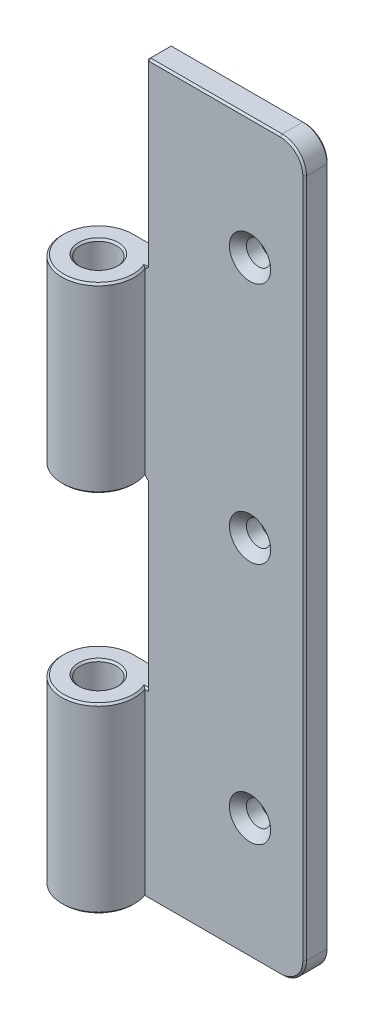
ISO-10303-21;
HEADER;
FILE_DESCRIPTION(('STEP AP214'),'2;1');
FILE_NAME('part.step','',(''),(''),'','','');
FILE_SCHEMA(('AUTOMOTIVE_DESIGN { 1 0 10303 214 1 1 1 1 }'));
ENDSEC;
DATA;
#1=APPLICATION_CONTEXT('core data for automotive mechanical design processes');
#2=APPLICATION_PROTOCOL_DEFINITION('international standard','automotive_design',2000,#1);
#3=PRODUCT_CONTEXT('',#1,'mechanical');
#4=PRODUCT('Part','Part','',(#3));
#5=PRODUCT_RELATED_PRODUCT_CATEGORY('part','',(#4));
#6=PRODUCT_DEFINITION_FORMATION('','',#4);
#7=PRODUCT_DEFINITION_CONTEXT('part definition',#1,'design');
#8=PRODUCT_DEFINITION('design','',#6,#7);
#9=PRODUCT_DEFINITION_SHAPE('','',#8);
#10=(LENGTH_UNIT() NAMED_UNIT(*) SI_UNIT(.MILLI.,.METRE.));
#11=(NAMED_UNIT(*) PLANE_ANGLE_UNIT() SI_UNIT($,.RADIAN.));
#12=(NAMED_UNIT(*) SI_UNIT($,.STERADIAN.) SOLID_ANGLE_UNIT());
#13=UNCERTAINTY_MEASURE_WITH_UNIT(LENGTH_MEASURE(1.E-05),#10,'distance_accuracy_value','');
#14=(GEOMETRIC_REPRESENTATION_CONTEXT(3) GLOBAL_UNCERTAINTY_ASSIGNED_CONTEXT((#13)) GLOBAL_UNIT_ASSIGNED_CONTEXT((#10,
#11,#12)) REPRESENTATION_CONTEXT('',''));
#15=CARTESIAN_POINT('',(0.,0.,0.));
#16=DIRECTION('',(0.,0.,1.));
#17=DIRECTION('',(1.,0.,0.));
#18=AXIS2_PLACEMENT_3D('',#15,#16,#17);
#19=CARTESIAN_POINT('',(1.11803398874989,60.,-1.));
#20=DIRECTION('',(0.,0.,-1.));
#21=DIRECTION('',(-1.,0.,0.));
#22=AXIS2_PLACEMENT_3D('',#19,#20,#21);
#23=PLANE('',#22);
#24=CARTESIAN_POINT('',(11.5,10.,-1.));
#25=DIRECTION('',(0.,0.,-1.));
#26=DIRECTION('',(-1.,0.,0.));
#27=AXIS2_PLACEMENT_3D('',#24,#25,#26);
#28=CIRCLE('',#27,1.69999999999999);
#29=CARTESIAN_POINT('',(9.80000000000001,10.,-1.));
#30=VERTEX_POINT('',#29);
#31=EDGE_CURVE('E619',#30,#30,#28,.T.);
#32=ORIENTED_EDGE('',*,*,#31,.T.);
#33=EDGE_LOOP('',(#32));
#34=FACE_BOUND('',#33,.T.);
#35=CARTESIAN_POINT('',(11.5,30.,-1.));
#36=DIRECTION('',(0.,0.,-1.));
#37=DIRECTION('',(-1.,0.,0.));
#38=AXIS2_PLACEMENT_3D('',#35,#36,#37);
#39=CIRCLE('',#38,1.69999999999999);
#40=CARTESIAN_POINT('',(9.80000000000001,30.,-1.));
#41=VERTEX_POINT('',#40);
#42=EDGE_CURVE('E622',#41,#41,#39,.T.);
#43=ORIENTED_EDGE('',*,*,#42,.T.);
#44=EDGE_LOOP('',(#43));
#45=FACE_BOUND('',#44,.T.);
#46=CARTESIAN_POINT('',(11.5,50.,-1.));
#47=DIRECTION('',(0.,0.,-1.));
#48=DIRECTION('',(-1.,0.,0.));
#49=AXIS2_PLACEMENT_3D('',#46,#47,#48);
#50=CIRCLE('',#49,1.69999999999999);
#51=CARTESIAN_POINT('',(9.80000000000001,50.,-1.));
#52=VERTEX_POINT('',#51);
#53=EDGE_CURVE('E625',#52,#52,#50,.T.);
#54=ORIENTED_EDGE('',*,*,#53,.T.);
#55=EDGE_LOOP('',(#54));
#56=FACE_BOUND('',#55,.T.);
#57=DIRECTION('',(0.707106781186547,0.707106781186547,0.));
#58=VECTOR('',#57,1.);
#59=CARTESIAN_POINT('',(3.15,45.15,-1.));
#60=LINE('',#59,#58);
#61=CARTESIAN_POINT('',(2.85,44.85,-1.));
#62=VERTEX_POINT('',#61);
#63=CARTESIAN_POINT('',(3.,45.,-1.));
#64=VERTEX_POINT('',#63);
#65=EDGE_CURVE('E323',#62,#64,#60,.T.);
#66=ORIENTED_EDGE('',*,*,#65,.F.);
#67=DIRECTION('',(-1.,0.,0.));
#68=VECTOR('',#67,1.);
#69=CARTESIAN_POINT('',(2.82842712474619,44.85,-1.));
#70=LINE('',#69,#68);
#71=CARTESIAN_POINT('',(2.82842712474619,44.85,-1.));
#72=VERTEX_POINT('',#71);
#73=EDGE_CURVE('E326',#62,#72,#70,.T.);
#74=ORIENTED_EDGE('',*,*,#73,.T.);
#75=DIRECTION('',(0.,-1.,0.));
#76=VECTOR('',#75,1.);
#77=CARTESIAN_POINT('',(2.82842712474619,45.,-1.));
#78=LINE('',#77,#76);
#79=CARTESIAN_POINT('',(2.82842712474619,30.15,-1.));
#80=VERTEX_POINT('',#79);
#81=EDGE_CURVE('E647',#80,#72,#78,.F.);
#82=ORIENTED_EDGE('',*,*,#81,.F.);
#83=DIRECTION('',(1.,0.,0.));
#84=VECTOR('',#83,1.);
#85=CARTESIAN_POINT('',(1.11803398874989,30.15,-1.));
#86=LINE('',#85,#84);
#87=CARTESIAN_POINT('',(2.84999999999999,30.15,-1.));
#88=VERTEX_POINT('',#87);
#89=EDGE_CURVE('E306',#80,#88,#86,.T.);
#90=ORIENTED_EDGE('',*,*,#89,.T.);
#91=DIRECTION('',(-0.707106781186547,0.707106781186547,0.));
#92=VECTOR('',#91,1.);
#93=CARTESIAN_POINT('',(2.84999999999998,30.15,-1.));
#94=LINE('',#93,#92);
#95=CARTESIAN_POINT('',(3.,30.,-1.));
#96=VERTEX_POINT('',#95);
#97=EDGE_CURVE('E303',#96,#88,#94,.T.);
#98=ORIENTED_EDGE('',*,*,#97,.F.);
#99=DIRECTION('',(-0.707106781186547,0.707106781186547,0.));
#100=VECTOR('',#99,1.);
#101=CARTESIAN_POINT('',(2.84999999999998,30.15,-1.));
#102=LINE('',#101,#100);
#103=CARTESIAN_POINT('',(3.15000000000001,29.85,-1.));
#104=VERTEX_POINT('',#103);
#105=EDGE_CURVE('E300',#104,#96,#102,.T.);
#106=ORIENTED_EDGE('',*,*,#105,.F.);
#107=DIRECTION('',(0.,-1.,0.));
#108=VECTOR('',#107,1.);
#109=CARTESIAN_POINT('',(3.15000000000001,60.,-1.));
#110=LINE('',#109,#108);
#111=CARTESIAN_POINT('',(3.15000000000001,14.85,-1.));
#112=VERTEX_POINT('',#111);
#113=EDGE_CURVE('E298',#104,#112,#110,.T.);
#114=ORIENTED_EDGE('',*,*,#113,.T.);
#115=DIRECTION('',(-1.,0.,0.));
#116=VECTOR('',#115,1.);
#117=CARTESIAN_POINT('',(1.11803398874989,14.85,-1.));
#118=LINE('',#117,#116);
#119=CARTESIAN_POINT('',(2.82842712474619,14.85,-1.));
#120=VERTEX_POINT('',#119);
#121=EDGE_CURVE('E296',#112,#120,#118,.T.);
#122=ORIENTED_EDGE('',*,*,#121,.T.);
#123=DIRECTION('',(0.,-1.,0.));
#124=VECTOR('',#123,1.);
#125=CARTESIAN_POINT('',(2.82842712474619,45.,-1.));
#126=LINE('',#125,#124);
#127=CARTESIAN_POINT('',(2.82842712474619,0.150000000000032,-1.));
#128=VERTEX_POINT('',#127);
#129=EDGE_CURVE('E640',#120,#128,#126,.T.);
#130=ORIENTED_EDGE('',*,*,#129,.T.);
#131=DIRECTION('',(1.,0.,0.));
#132=VECTOR('',#131,1.);
#133=CARTESIAN_POINT('',(1.11803398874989,0.150000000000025,-1.));
#134=LINE('',#133,#132);
#135=CARTESIAN_POINT('',(14.,0.150000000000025,-1.));
#136=VERTEX_POINT('',#135);
#137=EDGE_CURVE('E308',#128,#136,#134,.T.);
#138=ORIENTED_EDGE('',*,*,#137,.T.);
#139=CARTESIAN_POINT('',(14.,2.,-1.));
#140=DIRECTION('',(0.,0.,-1.));
#141=DIRECTION('',(-1.,0.,0.));
#142=AXIS2_PLACEMENT_3D('',#139,#140,#141);
#143=CIRCLE('',#142,1.84999999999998);
#144=CARTESIAN_POINT('',(15.85,2.,-1.));
#145=VERTEX_POINT('',#144);
#146=EDGE_CURVE('E310',#136,#145,#143,.F.);
#147=ORIENTED_EDGE('',*,*,#146,.T.);
#148=DIRECTION('',(0.,1.,0.));
#149=VECTOR('',#148,1.);
#150=CARTESIAN_POINT('',(15.85,60.,-1.));
#151=LINE('',#150,#149);
#152=CARTESIAN_POINT('',(15.85,58.,-1.));
#153=VERTEX_POINT('',#152);
#154=EDGE_CURVE('E312',#145,#153,#151,.T.);
#155=ORIENTED_EDGE('',*,*,#154,.T.);
#156=CARTESIAN_POINT('',(14.,58.,-1.));
#157=DIRECTION('',(0.,0.,-1.));
#158=DIRECTION('',(-1.,0.,0.));
#159=AXIS2_PLACEMENT_3D('',#156,#157,#158);
#160=CIRCLE('',#159,1.84999999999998);
#161=CARTESIAN_POINT('',(14.,59.85,-1.));
#162=VERTEX_POINT('',#161);
#163=EDGE_CURVE('E314',#153,#162,#160,.F.);
#164=ORIENTED_EDGE('',*,*,#163,.T.);
#165=DIRECTION('',(-1.,0.,0.));
#166=VECTOR('',#165,1.);
#167=CARTESIAN_POINT('',(3.,59.85,-1.));
#168=LINE('',#167,#166);
#169=CARTESIAN_POINT('',(3.15,59.85,-1.));
#170=VERTEX_POINT('',#169);
#171=EDGE_CURVE('E316',#162,#170,#168,.T.);
#172=ORIENTED_EDGE('',*,*,#171,.T.);
#173=DIRECTION('',(0.,-1.,0.));
#174=VECTOR('',#173,1.);
#175=CARTESIAN_POINT('',(3.15,60.,-1.));
#176=LINE('',#175,#174);
#177=CARTESIAN_POINT('',(3.15,45.15,-1.));
#178=VERTEX_POINT('',#177);
#179=EDGE_CURVE('E318',#170,#178,#176,.T.);
#180=ORIENTED_EDGE('',*,*,#179,.T.);
#181=DIRECTION('',(0.707106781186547,0.707106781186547,0.));
#182=VECTOR('',#181,1.);
#183=CARTESIAN_POINT('',(3.15,45.15,-1.));
#184=LINE('',#183,#182);
#185=EDGE_CURVE('E320',#64,#178,#184,.T.);
#186=ORIENTED_EDGE('',*,*,#185,.F.);
#187=EDGE_LOOP('',(#66,#74,#82,#90,#98,#106,#114,#122,#130,#138,#147,#155,#164,#172,#180,#186));
#188=FACE_BOUND('',#187,.T.);
#189=ADVANCED_FACE('F31',(#34,#45,#56,#188),#23,.F.);
#190=CARTESIAN_POINT('',(0.,60.,-3.));
#191=DIRECTION('',(0.,0.,1.));
#192=DIRECTION('',(1.,0.,0.));
#193=AXIS2_PLACEMENT_3D('',#190,#191,#192);
#194=PLANE('',#193);
#195=CARTESIAN_POINT('',(11.5,10.,-3.));
#196=DIRECTION('',(0.,0.,1.));
#197=DIRECTION('',(1.,0.,0.));
#198=AXIS2_PLACEMENT_3D('',#195,#196,#197);
#199=CIRCLE('',#198,1.15000000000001);
#200=CARTESIAN_POINT('',(12.65,10.,-3.));
#201=VERTEX_POINT('',#200);
#202=EDGE_CURVE('E284',#201,#201,#199,.T.);
#203=ORIENTED_EDGE('',*,*,#202,.T.);
#204=EDGE_LOOP('',(#203));
#205=FACE_BOUND('',#204,.T.);
#206=CARTESIAN_POINT('',(11.5,30.,-3.));
#207=DIRECTION('',(0.,0.,1.));
#208=DIRECTION('',(1.,0.,0.));
#209=AXIS2_PLACEMENT_3D('',#206,#207,#208);
#210=CIRCLE('',#209,1.15000000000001);
#211=CARTESIAN_POINT('',(12.65,30.,-3.));
#212=VERTEX_POINT('',#211);
#213=EDGE_CURVE('E281',#212,#212,#210,.T.);
#214=ORIENTED_EDGE('',*,*,#213,.T.);
#215=EDGE_LOOP('',(#214));
#216=FACE_BOUND('',#215,.T.);
#217=CARTESIAN_POINT('',(11.5,50.,-3.));
#218=DIRECTION('',(0.,0.,1.));
#219=DIRECTION('',(1.,0.,0.));
#220=AXIS2_PLACEMENT_3D('',#217,#218,#219);
#221=CIRCLE('',#220,1.15000000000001);
#222=CARTESIAN_POINT('',(12.65,50.,-3.));
#223=VERTEX_POINT('',#222);
#224=EDGE_CURVE('E278',#223,#223,#221,.T.);
#225=ORIENTED_EDGE('',*,*,#224,.T.);
#226=EDGE_LOOP('',(#225));
#227=FACE_BOUND('',#226,.T.);
#228=DIRECTION('',(0.,-1.,0.));
#229=VECTOR('',#228,1.);
#230=CARTESIAN_POINT('',(0.,60.,-3.));
#231=LINE('',#230,#229);
#232=CARTESIAN_POINT('',(0.,44.85,-3.));
#233=VERTEX_POINT('',#232);
#234=CARTESIAN_POINT('',(0.,30.15,-3.));
#235=VERTEX_POINT('',#234);
#236=EDGE_CURVE('E643',#233,#235,#231,.T.);
#237=ORIENTED_EDGE('',*,*,#236,.F.);
#238=DIRECTION('',(1.,0.,0.));
#239=VECTOR('',#238,1.);
#240=CARTESIAN_POINT('',(3.,44.85,-3.));
#241=LINE('',#240,#239);
#242=CARTESIAN_POINT('',(2.85,44.85,-3.));
#243=VERTEX_POINT('',#242);
#244=EDGE_CURVE('E276',#233,#243,#241,.T.);
#245=ORIENTED_EDGE('',*,*,#244,.T.);
#246=DIRECTION('',(-0.707106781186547,-0.707106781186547,0.));
#247=VECTOR('',#246,1.);
#248=CARTESIAN_POINT('',(2.84999999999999,44.85,-3.));
#249=LINE('',#248,#247);
#250=CARTESIAN_POINT('',(3.,45.,-3.));
#251=VERTEX_POINT('',#250);
#252=EDGE_CURVE('E273',#251,#243,#249,.T.);
#253=ORIENTED_EDGE('',*,*,#252,.F.);
#254=DIRECTION('',(-0.707106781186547,-0.707106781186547,0.));
#255=VECTOR('',#254,1.);
#256=CARTESIAN_POINT('',(2.84999999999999,44.85,-3.));
#257=LINE('',#256,#255);
#258=CARTESIAN_POINT('',(3.15,45.15,-3.));
#259=VERTEX_POINT('',#258);
#260=EDGE_CURVE('E270',#259,#251,#257,.T.);
#261=ORIENTED_EDGE('',*,*,#260,.F.);
#262=DIRECTION('',(0.,1.,0.));
#263=VECTOR('',#262,1.);
#264=CARTESIAN_POINT('',(3.15,60.,-3.));
#265=LINE('',#264,#263);
#266=CARTESIAN_POINT('',(3.15,59.85,-3.));
#267=VERTEX_POINT('',#266);
#268=EDGE_CURVE('E268',#259,#267,#265,.T.);
#269=ORIENTED_EDGE('',*,*,#268,.T.);
#270=DIRECTION('',(1.,0.,0.));
#271=VECTOR('',#270,1.);
#272=CARTESIAN_POINT('',(14.,59.85,-3.));
#273=LINE('',#272,#271);
#274=CARTESIAN_POINT('',(14.,59.85,-3.));
#275=VERTEX_POINT('',#274);
#276=EDGE_CURVE('E266',#267,#275,#273,.T.);
#277=ORIENTED_EDGE('',*,*,#276,.T.);
#278=CARTESIAN_POINT('',(14.,58.,-3.));
#279=DIRECTION('',(0.,0.,1.));
#280=DIRECTION('',(1.,0.,0.));
#281=AXIS2_PLACEMENT_3D('',#278,#279,#280);
#282=CIRCLE('',#281,1.84999999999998);
#283=CARTESIAN_POINT('',(15.85,58.,-3.));
#284=VERTEX_POINT('',#283);
#285=EDGE_CURVE('E264',#275,#284,#282,.F.);
#286=ORIENTED_EDGE('',*,*,#285,.T.);
#287=DIRECTION('',(0.,-1.,0.));
#288=VECTOR('',#287,1.);
#289=CARTESIAN_POINT('',(15.85,60.,-3.));
#290=LINE('',#289,#288);
#291=CARTESIAN_POINT('',(15.85,2.,-3.));
#292=VERTEX_POINT('',#291);
#293=EDGE_CURVE('E262',#284,#292,#290,.T.);
#294=ORIENTED_EDGE('',*,*,#293,.T.);
#295=CARTESIAN_POINT('',(14.,2.,-3.));
#296=DIRECTION('',(0.,0.,1.));
#297=DIRECTION('',(1.,0.,0.));
#298=AXIS2_PLACEMENT_3D('',#295,#296,#297);
#299=CIRCLE('',#298,1.84999999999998);
#300=CARTESIAN_POINT('',(14.,0.150000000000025,-3.));
#301=VERTEX_POINT('',#300);
#302=EDGE_CURVE('E260',#292,#301,#299,.F.);
#303=ORIENTED_EDGE('',*,*,#302,.T.);
#304=DIRECTION('',(-1.,0.,0.));
#305=VECTOR('',#304,1.);
#306=CARTESIAN_POINT('',(0.,0.150000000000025,-3.));
#307=LINE('',#306,#305);
#308=CARTESIAN_POINT('',(0.,0.150000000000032,-3.));
#309=VERTEX_POINT('',#308);
#310=EDGE_CURVE('E258',#301,#309,#307,.T.);
#311=ORIENTED_EDGE('',*,*,#310,.T.);
#312=CARTESIAN_POINT('',(0.,14.85,-3.));
#313=VERTEX_POINT('',#312);
#314=EDGE_CURVE('E646',#313,#309,#231,.T.);
#315=ORIENTED_EDGE('',*,*,#314,.F.);
#316=DIRECTION('',(1.,0.,0.));
#317=VECTOR('',#316,1.);
#318=CARTESIAN_POINT('',(0.,14.85,-3.));
#319=LINE('',#318,#317);
#320=CARTESIAN_POINT('',(3.15000000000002,14.85,-3.));
#321=VERTEX_POINT('',#320);
#322=EDGE_CURVE('E256',#313,#321,#319,.T.);
#323=ORIENTED_EDGE('',*,*,#322,.T.);
#324=DIRECTION('',(0.,1.,0.));
#325=VECTOR('',#324,1.);
#326=CARTESIAN_POINT('',(3.15000000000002,60.,-3.));
#327=LINE('',#326,#325);
#328=CARTESIAN_POINT('',(3.15000000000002,29.85,-3.));
#329=VERTEX_POINT('',#328);
#330=EDGE_CURVE('E239',#321,#329,#327,.T.);
#331=ORIENTED_EDGE('',*,*,#330,.T.);
#332=DIRECTION('',(0.707106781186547,-0.707106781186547,0.));
#333=VECTOR('',#332,1.);
#334=CARTESIAN_POINT('',(3.15000000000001,29.85,-3.));
#335=LINE('',#334,#333);
#336=CARTESIAN_POINT('',(3.,30.,-3.));
#337=VERTEX_POINT('',#336);
#338=EDGE_CURVE('E232',#337,#329,#335,.T.);
#339=ORIENTED_EDGE('',*,*,#338,.F.);
#340=DIRECTION('',(0.707106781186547,-0.707106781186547,0.));
#341=VECTOR('',#340,1.);
#342=CARTESIAN_POINT('',(3.15000000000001,29.85,-3.));
#343=LINE('',#342,#341);
#344=CARTESIAN_POINT('',(2.84999999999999,30.15,-3.));
#345=VERTEX_POINT('',#344);
#346=EDGE_CURVE('E236',#345,#337,#343,.T.);
#347=ORIENTED_EDGE('',*,*,#346,.F.);
#348=DIRECTION('',(-1.,0.,0.));
#349=VECTOR('',#348,1.);
#350=CARTESIAN_POINT('',(0.,30.15,-3.));
#351=LINE('',#350,#349);
#352=EDGE_CURVE('E251',#345,#235,#351,.T.);
#353=ORIENTED_EDGE('',*,*,#352,.T.);
#354=EDGE_LOOP('',(#237,#245,#253,#261,#269,#277,#286,#294,#303,#311,#315,#323,#331,#339,#347,#353));
#355=FACE_BOUND('',#354,.T.);
#356=ADVANCED_FACE('F235',(#205,#216,#227,#355),#194,.F.);
#357=CARTESIAN_POINT('',(0.,45.,0.));
#358=DIRECTION('',(0.,-1.,0.));
#359=DIRECTION('',(0.,0.,-1.));
#360=AXIS2_PLACEMENT_3D('',#357,#358,#359);
#361=CYLINDRICAL_SURFACE('',#360,1.5);
#362=CARTESIAN_POINT('',(0.,0.149999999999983,0.));
#363=DIRECTION('',(0.,1.,0.));
#364=DIRECTION('',(0.,0.,1.));
#365=AXIS2_PLACEMENT_3D('',#362,#363,#364);
#366=CIRCLE('',#365,1.5);
#367=CARTESIAN_POINT('',(0.,0.149999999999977,-1.5));
#368=VERTEX_POINT('',#367);
#369=EDGE_CURVE('E595',#368,#368,#366,.F.);
#370=CARTESIAN_POINT('',(0.,14.8500000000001,0.));
#371=DIRECTION('',(0.,-1.,0.));
#372=DIRECTION('',(0.,0.,-1.));
#373=AXIS2_PLACEMENT_3D('',#370,#371,#372);
#374=CIRCLE('',#373,1.5);
#375=CARTESIAN_POINT('',(0.,14.8500000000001,-1.5));
#376=VERTEX_POINT('',#375);
#377=EDGE_CURVE('E598',#376,#376,#374,.F.);
#378=CARTESIAN_POINT('',(0.,0.149999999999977,-1.5));
#379=CARTESIAN_POINT('',(0.,0.303124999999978,-1.5));
#380=CARTESIAN_POINT('',(0.,0.45624999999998,-1.5));
#381=CARTESIAN_POINT('',(0.,0.762499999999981,-1.5));
#382=CARTESIAN_POINT('',(0.,0.91562499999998,-1.5));
#383=CARTESIAN_POINT('',(0.,1.22187499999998,-1.5));
#384=CARTESIAN_POINT('',(0.,1.37499999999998,-1.5));
#385=CARTESIAN_POINT('',(0.,1.68124999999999,-1.5));
#386=CARTESIAN_POINT('',(0.,1.83437499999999,-1.5));
#387=CARTESIAN_POINT('',(0.,2.14062499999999,-1.5));
#388=CARTESIAN_POINT('',(0.,2.29374999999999,-1.5));
#389=CARTESIAN_POINT('',(0.,2.59999999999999,-1.5));
#390=CARTESIAN_POINT('',(0.,2.75312499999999,-1.5));
#391=CARTESIAN_POINT('',(0.,3.05937499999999,-1.5));
#392=CARTESIAN_POINT('',(0.,3.2125,-1.5));
#393=CARTESIAN_POINT('',(0.,3.51875,-1.5));
#394=CARTESIAN_POINT('',(0.,3.671875,-1.5));
#395=CARTESIAN_POINT('',(0.,3.978125,-1.5));
#396=CARTESIAN_POINT('',(0.,4.13125,-1.5));
#397=CARTESIAN_POINT('',(0.,4.4375,-1.5));
#398=CARTESIAN_POINT('',(0.,4.590625,-1.5));
#399=CARTESIAN_POINT('',(0.,4.89687500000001,-1.5));
#400=CARTESIAN_POINT('',(0.,5.05000000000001,-1.5));
#401=CARTESIAN_POINT('',(0.,5.35625000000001,-1.5));
#402=CARTESIAN_POINT('',(0.,5.50937500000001,-1.5));
#403=CARTESIAN_POINT('',(0.,5.81562500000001,-1.5));
#404=CARTESIAN_POINT('',(0.,5.96875000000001,-1.5));
#405=CARTESIAN_POINT('',(0.,6.27500000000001,-1.5));
#406=CARTESIAN_POINT('',(0.,6.42812500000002,-1.5));
#407=CARTESIAN_POINT('',(0.,6.73437500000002,-1.5));
#408=CARTESIAN_POINT('',(0.,6.88750000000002,-1.5));
#409=CARTESIAN_POINT('',(0.,7.19375000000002,-1.5));
#410=CARTESIAN_POINT('',(0.,7.34687500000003,-1.5));
#411=CARTESIAN_POINT('',(0.,7.65312500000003,-1.5));
#412=CARTESIAN_POINT('',(0.,7.80625000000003,-1.5));
#413=CARTESIAN_POINT('',(0.,8.11250000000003,-1.5));
#414=CARTESIAN_POINT('',(0.,8.26562500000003,-1.5));
#415=CARTESIAN_POINT('',(0.,8.57187500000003,-1.5));
#416=CARTESIAN_POINT('',(0.,8.72500000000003,-1.5));
#417=CARTESIAN_POINT('',(0.,9.03125000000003,-1.5));
#418=CARTESIAN_POINT('',(0.,9.18437500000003,-1.5));
#419=CARTESIAN_POINT('',(0.,9.49062500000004,-1.5));
#420=CARTESIAN_POINT('',(0.,9.64375000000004,-1.5));
#421=CARTESIAN_POINT('',(0.,9.95000000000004,-1.5));
#422=CARTESIAN_POINT('',(0.,10.103125,-1.5));
#423=CARTESIAN_POINT('',(0.,10.409375,-1.5));
#424=CARTESIAN_POINT('',(0.,10.5625,-1.5));
#425=CARTESIAN_POINT('',(0.,10.86875,-1.5));
#426=CARTESIAN_POINT('',(0.,11.021875,-1.5));
#427=CARTESIAN_POINT('',(0.,11.328125,-1.5));
#428=CARTESIAN_POINT('',(0.,11.48125,-1.5));
#429=CARTESIAN_POINT('',(0.,11.7875000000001,-1.5));
#430=CARTESIAN_POINT('',(0.,11.9406250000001,-1.5));
#431=CARTESIAN_POINT('',(0.,12.2468750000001,-1.5));
#432=CARTESIAN_POINT('',(0.,12.4000000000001,-1.5));
#433=CARTESIAN_POINT('',(0.,12.7062500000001,-1.5));
#434=CARTESIAN_POINT('',(0.,12.8593750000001,-1.5));
#435=CARTESIAN_POINT('',(0.,13.1656250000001,-1.5));
#436=CARTESIAN_POINT('',(0.,13.3187500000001,-1.5));
#437=CARTESIAN_POINT('',(0.,13.6250000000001,-1.5));
#438=CARTESIAN_POINT('',(0.,13.7781250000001,-1.5));
#439=CARTESIAN_POINT('',(0.,14.0843750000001,-1.5));
#440=CARTESIAN_POINT('',(0.,14.2375000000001,-1.5));
#441=CARTESIAN_POINT('',(0.,14.5437500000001,-1.5));
#442=CARTESIAN_POINT('',(0.,14.6968750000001,-1.5));
#443=CARTESIAN_POINT('',(0.,14.8500000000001,-1.5));
#444=B_SPLINE_CURVE_WITH_KNOTS('',3,(#378,#379,#380,#381,#382,#383,#384,#385,#386,#387,#388,
#389,#390,#391,#392,#393,#394,#395,#396,#397,#398,#399,#400,#401,#402,#403,#404,#405,#406,#407,
#408,#409,#410,#411,#412,#413,#414,#415,#416,#417,#418,#419,#420,#421,#422,#423,#424,#425,#426,
#427,#428,#429,#430,#431,#432,#433,#434,#435,#436,#437,#438,#439,#440,#441,#442,#443),
.UNSPECIFIED.,.F.,.F.,(4,2,2,2,2,2,2,2,2,2,2,2,2,2,2,2,2,2,2,2,2,2,2,2,2,2,2,2,2,2,2,2,4),(0.,
0.459375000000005,0.918750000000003,1.37812500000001,1.83750000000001,2.29687500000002,
2.75625000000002,3.21562500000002,3.67500000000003,4.13437500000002,4.59375000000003,
5.05312500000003,5.51250000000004,5.97187500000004,6.43125000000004,6.89062500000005,
7.35000000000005,7.80937500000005,8.26875000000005,8.72812500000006,9.18750000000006,
9.64687500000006,10.1062500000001,10.5656250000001,11.0250000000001,11.4843750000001,
11.9437500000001,12.4031250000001,12.8625000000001,13.3218750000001,13.7812500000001,
14.2406250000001,14.7000000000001),.UNSPECIFIED.);
#445=EDGE_CURVE('BSEAM823',#368,#376,#444,.T.);
#446=ORIENTED_EDGE('',*,*,#369,.T.);
#447=ORIENTED_EDGE('',*,*,#377,.T.);
#448=ORIENTED_EDGE('',*,*,#445,.T.);
#449=ORIENTED_EDGE('',*,*,#445,.F.);
#450=EDGE_LOOP('',(#446,#448,#447,#449));
#451=FACE_BOUND('',#450,.T.);
#452=ADVANCED_FACE('F823',(#451),#361,.F.);
#453=CARTESIAN_POINT('',(0.,45.,0.));
#454=DIRECTION('',(0.,-1.,0.));
#455=DIRECTION('',(0.,0.,-1.));
#456=AXIS2_PLACEMENT_3D('',#453,#454,#455);
#457=CYLINDRICAL_SURFACE('',#456,3.);
#458=ORIENTED_EDGE('',*,*,#314,.T.);
#459=CARTESIAN_POINT('',(0.,0.150000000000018,0.));
#460=DIRECTION('',(0.,1.,0.));
#461=DIRECTION('',(0.,0.,1.));
#462=AXIS2_PLACEMENT_3D('',#459,#460,#461);
#463=CIRCLE('',#462,3.);
#464=EDGE_CURVE('E364',#309,#128,#463,.T.);
#465=ORIENTED_EDGE('',*,*,#464,.T.);
#466=ORIENTED_EDGE('',*,*,#129,.F.);
#467=CARTESIAN_POINT('',(0.,14.85,0.));
#468=DIRECTION('',(0.,-1.,0.));
#469=DIRECTION('',(0.,0.,-1.));
#470=AXIS2_PLACEMENT_3D('',#467,#468,#469);
#471=CIRCLE('',#470,3.);
#472=EDGE_CURVE('E362',#120,#313,#471,.T.);
#473=ORIENTED_EDGE('',*,*,#472,.T.);
#474=EDGE_LOOP('',(#458,#465,#466,#473));
#475=FACE_BOUND('',#474,.T.);
#476=ADVANCED_FACE('F674',(#475),#457,.T.);
#477=CARTESIAN_POINT('',(3.,15.,-5.));
#478=DIRECTION('',(0.,-1.,0.));
#479=DIRECTION('',(0.,0.,-1.));
#480=AXIS2_PLACEMENT_3D('',#477,#478,#479);
#481=PLANE('',#480);
#482=CARTESIAN_POINT('',(0.,15.,0.));
#483=DIRECTION('',(0.,-1.,0.));
#484=DIRECTION('',(0.,0.,-1.));
#485=AXIS2_PLACEMENT_3D('',#482,#483,#484);
#486=CIRCLE('',#485,1.64999999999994);
#487=CARTESIAN_POINT('',(0.,15.,-1.64999999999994));
#488=VERTEX_POINT('',#487);
#489=EDGE_CURVE('E585',#488,#488,#486,.T.);
#490=ORIENTED_EDGE('',*,*,#489,.T.);
#491=EDGE_LOOP('',(#490));
#492=FACE_BOUND('',#491,.T.);
#493=DIRECTION('',(0.,0.,1.));
#494=VECTOR('',#493,1.);
#495=CARTESIAN_POINT('',(3.,15.,-5.));
#496=LINE('',#495,#494);
#497=CARTESIAN_POINT('',(3.,15.,-2.84999999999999));
#498=VERTEX_POINT('',#497);
#499=CARTESIAN_POINT('',(3.,15.,-1.15000000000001));
#500=VERTEX_POINT('',#499);
#501=EDGE_CURVE('E474',#498,#500,#496,.T.);
#502=ORIENTED_EDGE('',*,*,#501,.F.);
#503=DIRECTION('',(-1.,0.,0.));
#504=VECTOR('',#503,1.);
#505=CARTESIAN_POINT('',(3.,15.,-2.84999999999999));
#506=LINE('',#505,#504);
#507=CARTESIAN_POINT('',(0.,15.,-2.84999999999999));
#508=VERTEX_POINT('',#507);
#509=EDGE_CURVE('E588',#498,#508,#506,.T.);
#510=ORIENTED_EDGE('',*,*,#509,.T.);
#511=CARTESIAN_POINT('',(0.,15.,0.));
#512=DIRECTION('',(0.,-1.,0.));
#513=DIRECTION('',(0.,0.,-1.));
#514=AXIS2_PLACEMENT_3D('',#511,#512,#513);
#515=CIRCLE('',#514,2.84999999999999);
#516=CARTESIAN_POINT('',(2.60768096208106,15.,-1.14999999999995));
#517=VERTEX_POINT('',#516);
#518=EDGE_CURVE('E593',#508,#517,#515,.F.);
#519=ORIENTED_EDGE('',*,*,#518,.T.);
#520=DIRECTION('',(1.,0.,0.));
#521=VECTOR('',#520,1.);
#522=CARTESIAN_POINT('',(3.,15.,-1.15000000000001));
#523=LINE('',#522,#521);
#524=EDGE_CURVE('E591',#517,#500,#523,.T.);
#525=ORIENTED_EDGE('',*,*,#524,.T.);
#526=EDGE_LOOP('',(#502,#510,#519,#525));
#527=FACE_BOUND('',#526,.T.);
#528=ADVANCED_FACE('F666',(#492,#527),#481,.F.);
#529=CARTESIAN_POINT('',(0.,0.,0.));
#530=DIRECTION('',(0.,1.,0.));
#531=DIRECTION('',(0.,0.,1.));
#532=AXIS2_PLACEMENT_3D('',#529,#530,#531);
#533=PLANE('',#532);
#534=CARTESIAN_POINT('',(0.,0.,0.));
#535=DIRECTION('',(0.,1.,0.));
#536=DIRECTION('',(0.,0.,1.));
#537=AXIS2_PLACEMENT_3D('',#534,#535,#536);
#538=CIRCLE('',#537,1.64999999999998);
#539=CARTESIAN_POINT('',(0.,0.,1.64999999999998));
#540=VERTEX_POINT('',#539);
#541=EDGE_CURVE('E601',#540,#540,#538,.T.);
#542=ORIENTED_EDGE('',*,*,#541,.T.);
#543=EDGE_LOOP('',(#542));
#544=FACE_BOUND('',#543,.T.);
#545=CARTESIAN_POINT('',(0.,0.,0.));
#546=DIRECTION('',(0.,1.,0.));
#547=DIRECTION('',(0.,0.,1.));
#548=AXIS2_PLACEMENT_3D('',#545,#546,#547);
#549=CIRCLE('',#548,2.84999999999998);
#550=CARTESIAN_POINT('',(2.60768096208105,0.,-1.14999999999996));
#551=VERTEX_POINT('',#550);
#552=CARTESIAN_POINT('',(0.,0.,-2.84999999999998));
#553=VERTEX_POINT('',#552);
#554=EDGE_CURVE('E608',#551,#553,#549,.F.);
#555=ORIENTED_EDGE('',*,*,#554,.T.);
#556=DIRECTION('',(1.,0.,0.));
#557=VECTOR('',#556,1.);
#558=CARTESIAN_POINT('',(0.,0.,-2.84999999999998));
#559=LINE('',#558,#557);
#560=CARTESIAN_POINT('',(14.,0.,-2.84999999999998));
#561=VERTEX_POINT('',#560);
#562=EDGE_CURVE('E604',#553,#561,#559,.T.);
#563=ORIENTED_EDGE('',*,*,#562,.T.);
#564=DIRECTION('',(0.,0.,-1.));
#565=VECTOR('',#564,1.);
#566=CARTESIAN_POINT('',(14.,0.,0.));
#567=LINE('',#566,#565);
#568=CARTESIAN_POINT('',(14.,0.,-1.15000000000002));
#569=VERTEX_POINT('',#568);
#570=EDGE_CURVE('E631',#561,#569,#567,.F.);
#571=ORIENTED_EDGE('',*,*,#570,.T.);
#572=DIRECTION('',(-1.,0.,0.));
#573=VECTOR('',#572,1.);
#574=CARTESIAN_POINT('',(0.,0.,-1.15000000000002));
#575=LINE('',#574,#573);
#576=EDGE_CURVE('E606',#569,#551,#575,.T.);
#577=ORIENTED_EDGE('',*,*,#576,.T.);
#578=EDGE_LOOP('',(#555,#563,#571,#577));
#579=FACE_BOUND('',#578,.T.);
#580=ADVANCED_FACE('F807',(#544,#579),#533,.F.);
#581=CARTESIAN_POINT('',(0.,44.85,0.));
#582=DIRECTION('',(0.,1.,0.));
#583=DIRECTION('',(0.,0.,1.));
#584=AXIS2_PLACEMENT_3D('',#581,#582,#583);
#585=CIRCLE('',#584,1.5);
#586=CARTESIAN_POINT('',(0.,44.85,-1.5));
#587=VERTEX_POINT('',#586);
#588=EDGE_CURVE('E579',#587,#587,#585,.T.);
#589=CARTESIAN_POINT('',(0.,30.15,0.));
#590=DIRECTION('',(0.,1.,0.));
#591=DIRECTION('',(0.,0.,1.));
#592=AXIS2_PLACEMENT_3D('',#589,#590,#591);
#593=CIRCLE('',#592,1.5);
#594=CARTESIAN_POINT('',(0.,30.15,-1.5));
#595=VERTEX_POINT('',#594);
#596=EDGE_CURVE('E582',#595,#595,#593,.F.);
#597=CARTESIAN_POINT('',(0.,44.85,-1.5));
#598=CARTESIAN_POINT('',(0.,44.696875,-1.5));
#599=CARTESIAN_POINT('',(0.,44.54375,-1.5));
#600=CARTESIAN_POINT('',(0.,44.2375,-1.5));
#601=CARTESIAN_POINT('',(0.,44.084375,-1.5));
#602=CARTESIAN_POINT('',(0.,43.778125,-1.5));
#603=CARTESIAN_POINT('',(0.,43.625,-1.5));
#604=CARTESIAN_POINT('',(0.,43.31875,-1.5));
#605=CARTESIAN_POINT('',(0.,43.165625,-1.5));
#606=CARTESIAN_POINT('',(0.,42.859375,-1.5));
#607=CARTESIAN_POINT('',(0.,42.70625,-1.5));
#608=CARTESIAN_POINT('',(0.,42.4,-1.5));
#609=CARTESIAN_POINT('',(0.,42.246875,-1.5));
#610=CARTESIAN_POINT('',(0.,41.940625,-1.5));
#611=CARTESIAN_POINT('',(0.,41.7875,-1.5));
#612=CARTESIAN_POINT('',(0.,41.48125,-1.5));
#613=CARTESIAN_POINT('',(0.,41.328125,-1.5));
#614=CARTESIAN_POINT('',(0.,41.021875,-1.5));
#615=CARTESIAN_POINT('',(0.,40.86875,-1.5));
#616=CARTESIAN_POINT('',(0.,40.5625,-1.5));
#617=CARTESIAN_POINT('',(0.,40.409375,-1.5));
#618=CARTESIAN_POINT('',(0.,40.103125,-1.5));
#619=CARTESIAN_POINT('',(0.,39.95,-1.5));
#620=CARTESIAN_POINT('',(0.,39.64375,-1.5));
#621=CARTESIAN_POINT('',(0.,39.490625,-1.5));
#622=CARTESIAN_POINT('',(0.,39.184375,-1.5));
#623=CARTESIAN_POINT('',(0.,39.03125,-1.5));
#624=CARTESIAN_POINT('',(0.,38.725,-1.5));
#625=CARTESIAN_POINT('',(0.,38.571875,-1.5));
#626=CARTESIAN_POINT('',(0.,38.265625,-1.5));
#627=CARTESIAN_POINT('',(0.,38.1125,-1.5));
#628=CARTESIAN_POINT('',(0.,37.80625,-1.5));
#629=CARTESIAN_POINT('',(0.,37.653125,-1.5));
#630=CARTESIAN_POINT('',(0.,37.346875,-1.5));
#631=CARTESIAN_POINT('',(0.,37.19375,-1.5));
#632=CARTESIAN_POINT('',(0.,36.8875,-1.5));
#633=CARTESIAN_POINT('',(0.,36.734375,-1.5));
#634=CARTESIAN_POINT('',(0.,36.428125,-1.5));
#635=CARTESIAN_POINT('',(0.,36.275,-1.5));
#636=CARTESIAN_POINT('',(0.,35.96875,-1.5));
#637=CARTESIAN_POINT('',(0.,35.815625,-1.5));
#638=CARTESIAN_POINT('',(0.,35.509375,-1.5));
#639=CARTESIAN_POINT('',(0.,35.35625,-1.5));
#640=CARTESIAN_POINT('',(0.,35.05,-1.5));
#641=CARTESIAN_POINT('',(0.,34.896875,-1.5));
#642=CARTESIAN_POINT('',(0.,34.590625,-1.5));
#643=CARTESIAN_POINT('',(0.,34.4375,-1.5));
#644=CARTESIAN_POINT('',(0.,34.13125,-1.5));
#645=CARTESIAN_POINT('',(0.,33.978125,-1.5));
#646=CARTESIAN_POINT('',(0.,33.671875,-1.5));
#647=CARTESIAN_POINT('',(0.,33.51875,-1.5));
#648=CARTESIAN_POINT('',(0.,33.2125,-1.5));
#649=CARTESIAN_POINT('',(0.,33.059375,-1.5));
#650=CARTESIAN_POINT('',(0.,32.753125,-1.5));
#651=CARTESIAN_POINT('',(0.,32.6,-1.5));
#652=CARTESIAN_POINT('',(0.,32.29375,-1.5));
#653=CARTESIAN_POINT('',(0.,32.140625,-1.5));
#654=CARTESIAN_POINT('',(0.,31.834375,-1.5));
#655=CARTESIAN_POINT('',(0.,31.68125,-1.5));
#656=CARTESIAN_POINT('',(0.,31.375,-1.5));
#657=CARTESIAN_POINT('',(0.,31.221875,-1.5));
#658=CARTESIAN_POINT('',(0.,30.915625,-1.5));
#659=CARTESIAN_POINT('',(0.,30.7625,-1.5));
#660=CARTESIAN_POINT('',(0.,30.45625,-1.5));
#661=CARTESIAN_POINT('',(0.,30.303125,-1.5));
#662=CARTESIAN_POINT('',(0.,30.15,-1.5));
#663=B_SPLINE_CURVE_WITH_KNOTS('',3,(#597,#598,#599,#600,#601,#602,#603,#604,#605,#606,#607,
#608,#609,#610,#611,#612,#613,#614,#615,#616,#617,#618,#619,#620,#621,#622,#623,#624,#625,#626,
#627,#628,#629,#630,#631,#632,#633,#634,#635,#636,#637,#638,#639,#640,#641,#642,#643,#644,#645,
#646,#647,#648,#649,#650,#651,#652,#653,#654,#655,#656,#657,#658,#659,#660,#661,#662),
.UNSPECIFIED.,.F.,.F.,(4,2,2,2,2,2,2,2,2,2,2,2,2,2,2,2,2,2,2,2,2,2,2,2,2,2,2,2,2,2,2,2,4),(0.,
0.459375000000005,0.918750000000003,1.378125,1.8375,2.296875,2.75625,3.215625,3.675,4.134375,
4.59374999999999,5.05312499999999,5.5125,5.97187499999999,6.43124999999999,6.89062499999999,
7.34999999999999,7.80937499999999,8.26874999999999,8.72812499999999,9.18749999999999,
9.64687499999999,10.10625,10.565625,11.025,11.484375,11.94375,12.403125,12.8625,13.321875,
13.78125,14.240625,14.7),.UNSPECIFIED.);
#664=EDGE_CURVE('BSEAM832',#587,#595,#663,.T.);
#665=ORIENTED_EDGE('',*,*,#588,.T.);
#666=ORIENTED_EDGE('',*,*,#596,.T.);
#667=ORIENTED_EDGE('',*,*,#664,.T.);
#668=ORIENTED_EDGE('',*,*,#664,.F.);
#669=EDGE_LOOP('',(#665,#667,#666,#668));
#670=FACE_BOUND('',#669,.T.);
#671=ADVANCED_FACE('F832',(#670),#361,.F.);
#672=CARTESIAN_POINT('',(16.,60.,-3.));
#673=DIRECTION('',(-1.,0.,0.));
#674=DIRECTION('',(0.,0.,1.));
#675=AXIS2_PLACEMENT_3D('',#672,#673,#674);
#676=PLANE('',#675);
#677=DIRECTION('',(0.,0.,-1.));
#678=VECTOR('',#677,1.);
#679=CARTESIAN_POINT('',(16.,2.,-3.));
#680=LINE('',#679,#678);
#681=CARTESIAN_POINT('',(16.,2.,-1.15000000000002));
#682=VERTEX_POINT('',#681);
#683=CARTESIAN_POINT('',(16.,2.,-2.84999999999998));
#684=VERTEX_POINT('',#683);
#685=EDGE_CURVE('E634',#682,#684,#680,.T.);
#686=ORIENTED_EDGE('',*,*,#685,.T.);
#687=DIRECTION('',(0.,1.,0.));
#688=VECTOR('',#687,1.);
#689=CARTESIAN_POINT('',(16.,60.,-2.84999999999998));
#690=LINE('',#689,#688);
#691=CARTESIAN_POINT('',(16.,58.,-2.84999999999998));
#692=VERTEX_POINT('',#691);
#693=EDGE_CURVE('E356',#684,#692,#690,.T.);
#694=ORIENTED_EDGE('',*,*,#693,.T.);
#695=DIRECTION('',(0.,0.,-1.));
#696=VECTOR('',#695,1.);
#697=CARTESIAN_POINT('',(16.,58.,-1.));
#698=LINE('',#697,#696);
#699=CARTESIAN_POINT('',(16.,58.,-1.15000000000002));
#700=VERTEX_POINT('',#699);
#701=EDGE_CURVE('E637',#692,#700,#698,.F.);
#702=ORIENTED_EDGE('',*,*,#701,.T.);
#703=DIRECTION('',(0.,-1.,0.));
#704=VECTOR('',#703,1.);
#705=CARTESIAN_POINT('',(16.,60.,-1.15000000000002));
#706=LINE('',#705,#704);
#707=EDGE_CURVE('E354',#700,#682,#706,.T.);
#708=ORIENTED_EDGE('',*,*,#707,.T.);
#709=EDGE_LOOP('',(#686,#694,#702,#708));
#710=FACE_BOUND('',#709,.T.);
#711=ADVANCED_FACE('F694',(#710),#676,.F.);
#712=CARTESIAN_POINT('',(0.,60.,0.));
#713=DIRECTION('',(0.,1.,0.));
#714=DIRECTION('',(0.,0.,1.));
#715=AXIS2_PLACEMENT_3D('',#712,#713,#714);
#716=PLANE('',#715);
#717=DIRECTION('',(0.,0.,-1.));
#718=VECTOR('',#717,1.);
#719=CARTESIAN_POINT('',(14.,60.,-3.));
#720=LINE('',#719,#718);
#721=CARTESIAN_POINT('',(14.,60.,-1.15000000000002));
#722=VERTEX_POINT('',#721);
#723=CARTESIAN_POINT('',(14.,60.,-2.84999999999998));
#724=VERTEX_POINT('',#723);
#725=EDGE_CURVE('E628',#722,#724,#720,.T.);
#726=ORIENTED_EDGE('',*,*,#725,.T.);
#727=DIRECTION('',(-1.,0.,0.));
#728=VECTOR('',#727,1.);
#729=CARTESIAN_POINT('',(3.,60.,-2.84999999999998));
#730=LINE('',#729,#728);
#731=CARTESIAN_POINT('',(3.15,60.,-2.84999999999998));
#732=VERTEX_POINT('',#731);
#733=EDGE_CURVE('E343',#724,#732,#730,.T.);
#734=ORIENTED_EDGE('',*,*,#733,.T.);
#735=DIRECTION('',(0.,0.,1.));
#736=VECTOR('',#735,1.);
#737=CARTESIAN_POINT('',(3.15,60.,-1.));
#738=LINE('',#737,#736);
#739=CARTESIAN_POINT('',(3.15,60.,-1.15000000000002));
#740=VERTEX_POINT('',#739);
#741=EDGE_CURVE('E340',#732,#740,#738,.T.);
#742=ORIENTED_EDGE('',*,*,#741,.T.);
#743=DIRECTION('',(1.,0.,0.));
#744=VECTOR('',#743,1.);
#745=CARTESIAN_POINT('',(14.,60.,-1.15000000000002));
#746=LINE('',#745,#744);
#747=EDGE_CURVE('E338',#740,#722,#746,.T.);
#748=ORIENTED_EDGE('',*,*,#747,.T.);
#749=EDGE_LOOP('',(#726,#734,#742,#748));
#750=FACE_BOUND('',#749,.T.);
#751=ADVANCED_FACE('F735',(#750),#716,.T.);
#752=CARTESIAN_POINT('',(0.,45.,0.));
#753=DIRECTION('',(0.,-1.,0.));
#754=DIRECTION('',(0.,0.,-1.));
#755=AXIS2_PLACEMENT_3D('',#752,#753,#754);
#756=CYLINDRICAL_SURFACE('',#755,3.);
#757=ORIENTED_EDGE('',*,*,#81,.T.);
#758=CARTESIAN_POINT('',(0.,44.85,0.));
#759=DIRECTION('',(0.,1.,0.));
#760=DIRECTION('',(0.,0.,1.));
#761=AXIS2_PLACEMENT_3D('',#758,#759,#760);
#762=CIRCLE('',#761,3.);
#763=EDGE_CURVE('E348',#72,#233,#762,.F.);
#764=ORIENTED_EDGE('',*,*,#763,.T.);
#765=ORIENTED_EDGE('',*,*,#236,.T.);
#766=CARTESIAN_POINT('',(0.,30.15,0.));
#767=DIRECTION('',(0.,1.,0.));
#768=DIRECTION('',(0.,0.,1.));
#769=AXIS2_PLACEMENT_3D('',#766,#767,#768);
#770=CIRCLE('',#769,3.);
#771=EDGE_CURVE('E345',#235,#80,#770,.T.);
#772=ORIENTED_EDGE('',*,*,#771,.T.);
#773=EDGE_LOOP('',(#757,#764,#765,#772));
#774=FACE_BOUND('',#773,.T.);
#775=ADVANCED_FACE('F793',(#774),#756,.T.);
#776=CARTESIAN_POINT('',(0.,45.,0.));
#777=DIRECTION('',(0.,1.,0.));
#778=DIRECTION('',(0.,0.,1.));
#779=AXIS2_PLACEMENT_3D('',#776,#777,#778);
#780=PLANE('',#779);
#781=CARTESIAN_POINT('',(0.,45.,0.));
#782=DIRECTION('',(0.,1.,0.));
#783=DIRECTION('',(0.,0.,1.));
#784=AXIS2_PLACEMENT_3D('',#781,#782,#783);
#785=CIRCLE('',#784,1.65000000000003);
#786=CARTESIAN_POINT('',(0.,45.,1.65000000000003));
#787=VERTEX_POINT('',#786);
#788=EDGE_CURVE('E567',#787,#787,#785,.F.);
#789=ORIENTED_EDGE('',*,*,#788,.T.);
#790=EDGE_LOOP('',(#789));
#791=FACE_BOUND('',#790,.T.);
#792=CARTESIAN_POINT('',(0.,45.,0.));
#793=DIRECTION('',(0.,1.,0.));
#794=DIRECTION('',(0.,0.,1.));
#795=AXIS2_PLACEMENT_3D('',#792,#793,#794);
#796=CIRCLE('',#795,2.85000000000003);
#797=CARTESIAN_POINT('',(0.,45.,-2.85000000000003));
#798=VERTEX_POINT('',#797);
#799=CARTESIAN_POINT('',(2.60768096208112,45.,-1.14999999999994));
#800=VERTEX_POINT('',#799);
#801=EDGE_CURVE('E577',#798,#800,#796,.T.);
#802=ORIENTED_EDGE('',*,*,#801,.T.);
#803=DIRECTION('',(1.,0.,0.));
#804=VECTOR('',#803,1.);
#805=CARTESIAN_POINT('',(3.,45.,-1.15));
#806=LINE('',#805,#804);
#807=CARTESIAN_POINT('',(2.85,45.,-1.15));
#808=VERTEX_POINT('',#807);
#809=EDGE_CURVE('E570',#800,#808,#806,.T.);
#810=ORIENTED_EDGE('',*,*,#809,.T.);
#811=DIRECTION('',(0.,0.,-1.));
#812=VECTOR('',#811,1.);
#813=CARTESIAN_POINT('',(2.85,45.,0.));
#814=LINE('',#813,#812);
#815=CARTESIAN_POINT('',(2.85,45.,-2.85000000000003));
#816=VERTEX_POINT('',#815);
#817=EDGE_CURVE('E573',#808,#816,#814,.T.);
#818=ORIENTED_EDGE('',*,*,#817,.T.);
#819=DIRECTION('',(-1.,0.,0.));
#820=VECTOR('',#819,1.);
#821=CARTESIAN_POINT('',(0.,45.,-2.85000000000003));
#822=LINE('',#821,#820);
#823=EDGE_CURVE('E575',#816,#798,#822,.T.);
#824=ORIENTED_EDGE('',*,*,#823,.T.);
#825=EDGE_LOOP('',(#802,#810,#818,#824));
#826=FACE_BOUND('',#825,.T.);
#827=ADVANCED_FACE('F788',(#791,#826),#780,.T.);
#828=CARTESIAN_POINT('',(3.,30.,-5.));
#829=DIRECTION('',(0.,1.,0.));
#830=DIRECTION('',(0.,0.,1.));
#831=AXIS2_PLACEMENT_3D('',#828,#829,#830);
#832=PLANE('',#831);
#833=CARTESIAN_POINT('',(0.,30.,0.));
#834=DIRECTION('',(0.,1.,0.));
#835=DIRECTION('',(0.,0.,1.));
#836=AXIS2_PLACEMENT_3D('',#833,#834,#835);
#837=CIRCLE('',#836,1.64999999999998);
#838=CARTESIAN_POINT('',(0.,30.,-1.64999999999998));
#839=VERTEX_POINT('',#838);
#840=EDGE_CURVE('E243',#839,#839,#837,.T.);
#841=ORIENTED_EDGE('',*,*,#840,.T.);
#842=EDGE_LOOP('',(#841));
#843=FACE_BOUND('',#842,.T.);
#844=DIRECTION('',(-1.,0.,0.));
#845=VECTOR('',#844,1.);
#846=CARTESIAN_POINT('',(3.,30.,-1.15000000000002));
#847=LINE('',#846,#845);
#848=CARTESIAN_POINT('',(2.84999999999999,30.,-1.15000000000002));
#849=VERTEX_POINT('',#848);
#850=CARTESIAN_POINT('',(2.60768096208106,30.,-1.15000000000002));
#851=VERTEX_POINT('',#850);
#852=EDGE_CURVE('E558',#849,#851,#847,.T.);
#853=ORIENTED_EDGE('',*,*,#852,.T.);
#854=CARTESIAN_POINT('',(0.,30.,0.));
#855=DIRECTION('',(0.,1.,0.));
#856=DIRECTION('',(0.,0.,1.));
#857=AXIS2_PLACEMENT_3D('',#854,#855,#856);
#858=CIRCLE('',#857,2.84999999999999);
#859=CARTESIAN_POINT('',(0.,30.,-2.84999999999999));
#860=VERTEX_POINT('',#859);
#861=EDGE_CURVE('E553',#851,#860,#858,.F.);
#862=ORIENTED_EDGE('',*,*,#861,.T.);
#863=DIRECTION('',(1.,0.,0.));
#864=VECTOR('',#863,1.);
#865=CARTESIAN_POINT('',(3.,30.,-2.84999999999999));
#866=LINE('',#865,#864);
#867=CARTESIAN_POINT('',(2.84999999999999,30.,-2.84999999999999));
#868=VERTEX_POINT('',#867);
#869=EDGE_CURVE('E555',#860,#868,#866,.T.);
#870=ORIENTED_EDGE('',*,*,#869,.T.);
#871=DIRECTION('',(0.,0.,1.));
#872=VECTOR('',#871,1.);
#873=CARTESIAN_POINT('',(2.84999999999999,30.,-1.));
#874=LINE('',#873,#872);
#875=EDGE_CURVE('E559',#868,#849,#874,.T.);
#876=ORIENTED_EDGE('',*,*,#875,.T.);
#877=EDGE_LOOP('',(#853,#862,#870,#876));
#878=FACE_BOUND('',#877,.T.);
#879=ADVANCED_FACE('F561',(#843,#878),#832,.F.);
#880=CARTESIAN_POINT('',(3.,45.,-5.));
#881=DIRECTION('',(1.,0.,0.));
#882=DIRECTION('',(0.,0.,-1.));
#883=AXIS2_PLACEMENT_3D('',#880,#881,#882);
#884=PLANE('',#883);
#885=DIRECTION('',(0.,-1.,0.));
#886=VECTOR('',#885,1.);
#887=CARTESIAN_POINT('',(3.,45.,-2.85));
#888=LINE('',#887,#886);
#889=CARTESIAN_POINT('',(3.,59.85,-2.85));
#890=VERTEX_POINT('',#889);
#891=CARTESIAN_POINT('',(3.,45.15,-2.85));
#892=VERTEX_POINT('',#891);
#893=EDGE_CURVE('E329',#890,#892,#888,.T.);
#894=ORIENTED_EDGE('',*,*,#893,.T.);
#895=DIRECTION('',(0.,0.,1.));
#896=VECTOR('',#895,1.);
#897=CARTESIAN_POINT('',(3.,45.15,-5.));
#898=LINE('',#897,#896);
#899=CARTESIAN_POINT('',(3.,45.15,-1.15));
#900=VERTEX_POINT('',#899);
#901=EDGE_CURVE('E335',#892,#900,#898,.T.);
#902=ORIENTED_EDGE('',*,*,#901,.T.);
#903=DIRECTION('',(0.,1.,0.));
#904=VECTOR('',#903,1.);
#905=CARTESIAN_POINT('',(3.,45.,-1.15));
#906=LINE('',#905,#904);
#907=CARTESIAN_POINT('',(3.,59.85,-1.15));
#908=VERTEX_POINT('',#907);
#909=EDGE_CURVE('E333',#900,#908,#906,.T.);
#910=ORIENTED_EDGE('',*,*,#909,.T.);
#911=DIRECTION('',(0.,0.,-1.));
#912=VECTOR('',#911,1.);
#913=CARTESIAN_POINT('',(3.,59.85,-3.));
#914=LINE('',#913,#912);
#915=EDGE_CURVE('E331',#908,#890,#914,.T.);
#916=ORIENTED_EDGE('',*,*,#915,.T.);
#917=EDGE_LOOP('',(#894,#902,#910,#916));
#918=FACE_BOUND('',#917,.T.);
#919=ADVANCED_FACE('F905',(#918),#884,.F.);
#920=CARTESIAN_POINT('',(3.,30.,-5.));
#921=DIRECTION('',(1.,0.,0.));
#922=DIRECTION('',(0.,0.,-1.));
#923=AXIS2_PLACEMENT_3D('',#920,#921,#922);
#924=PLANE('',#923);
#925=DIRECTION('',(0.,0.,-1.));
#926=VECTOR('',#925,1.);
#927=CARTESIAN_POINT('',(3.,29.85,-3.));
#928=LINE('',#927,#926);
#929=CARTESIAN_POINT('',(3.,29.85,-1.15000000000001));
#930=VERTEX_POINT('',#929);
#931=CARTESIAN_POINT('',(3.,29.85,-2.84999999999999));
#932=VERTEX_POINT('',#931);
#933=EDGE_CURVE('E40',#930,#932,#928,.T.);
#934=ORIENTED_EDGE('',*,*,#933,.T.);
#935=DIRECTION('',(0.,-1.,0.));
#936=VECTOR('',#935,1.);
#937=CARTESIAN_POINT('',(3.,30.,-2.84999999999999));
#938=LINE('',#937,#936);
#939=EDGE_CURVE('E11',#932,#498,#938,.T.);
#940=ORIENTED_EDGE('',*,*,#939,.T.);
#941=ORIENTED_EDGE('',*,*,#501,.T.);
#942=DIRECTION('',(0.,1.,0.));
#943=VECTOR('',#942,1.);
#944=CARTESIAN_POINT('',(3.,30.,-1.15000000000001));
#945=LINE('',#944,#943);
#946=EDGE_CURVE('E51',#500,#930,#945,.T.);
#947=ORIENTED_EDGE('',*,*,#946,.T.);
#948=EDGE_LOOP('',(#934,#940,#941,#947));
#949=FACE_BOUND('',#948,.T.);
#950=ADVANCED_FACE('F652',(#949),#924,.F.);
#951=CARTESIAN_POINT('',(11.5,50.,-5.));
#952=DIRECTION('',(0.,0.,1.));
#953=DIRECTION('',(1.,0.,0.));
#954=AXIS2_PLACEMENT_3D('',#951,#952,#953);
#955=CYLINDRICAL_SURFACE('',#954,1.);
#956=CARTESIAN_POINT('',(11.5,50.,-2.84999999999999));
#957=DIRECTION('',(0.,0.,1.));
#958=DIRECTION('',(1.,0.,0.));
#959=AXIS2_PLACEMENT_3D('',#956,#957,#958);
#960=CIRCLE('',#959,1.);
#961=CARTESIAN_POINT('',(12.5,50.,-2.84999999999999));
#962=VERTEX_POINT('',#961);
#963=EDGE_CURVE('E293',#962,#962,#960,.F.);
#964=ORIENTED_EDGE('',*,*,#963,.T.);
#965=EDGE_LOOP('',(#964));
#966=FACE_BOUND('',#965,.T.);
#967=CARTESIAN_POINT('',(11.5,50.,-1.69999999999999));
#968=DIRECTION('',(0.,0.,-1.));
#969=DIRECTION('',(-1.,0.,0.));
#970=AXIS2_PLACEMENT_3D('',#967,#968,#969);
#971=CIRCLE('',#970,1.);
#972=CARTESIAN_POINT('',(10.5,50.,-1.69999999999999));
#973=VERTEX_POINT('',#972);
#974=EDGE_CURVE('E610',#973,#973,#971,.F.);
#975=ORIENTED_EDGE('',*,*,#974,.T.);
#976=EDGE_LOOP('',(#975));
#977=FACE_BOUND('',#976,.T.);
#978=ADVANCED_FACE('F890',(#966,#977),#955,.F.);
#979=CARTESIAN_POINT('',(11.5,30.,-5.));
#980=DIRECTION('',(0.,0.,1.));
#981=DIRECTION('',(1.,0.,0.));
#982=AXIS2_PLACEMENT_3D('',#979,#980,#981);
#983=CYLINDRICAL_SURFACE('',#982,1.);
#984=CARTESIAN_POINT('',(11.5,30.,-2.84999999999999));
#985=DIRECTION('',(0.,0.,1.));
#986=DIRECTION('',(1.,0.,0.));
#987=AXIS2_PLACEMENT_3D('',#984,#985,#986);
#988=CIRCLE('',#987,1.);
#989=CARTESIAN_POINT('',(12.5,30.,-2.84999999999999));
#990=VERTEX_POINT('',#989);
#991=EDGE_CURVE('E290',#990,#990,#988,.F.);
#992=ORIENTED_EDGE('',*,*,#991,.T.);
#993=EDGE_LOOP('',(#992));
#994=FACE_BOUND('',#993,.T.);
#995=CARTESIAN_POINT('',(11.5,30.,-1.69999999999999));
#996=DIRECTION('',(0.,0.,-1.));
#997=DIRECTION('',(-1.,0.,0.));
#998=AXIS2_PLACEMENT_3D('',#995,#996,#997);
#999=CIRCLE('',#998,1.);
#1000=CARTESIAN_POINT('',(10.5,30.,-1.69999999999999));
#1001=VERTEX_POINT('',#1000);
#1002=EDGE_CURVE('E613',#1001,#1001,#999,.F.);
#1003=ORIENTED_EDGE('',*,*,#1002,.T.);
#1004=EDGE_LOOP('',(#1003));
#1005=FACE_BOUND('',#1004,.T.);
#1006=ADVANCED_FACE('F893',(#994,#1005),#983,.F.);
#1007=CARTESIAN_POINT('',(11.5,10.,-5.));
#1008=DIRECTION('',(0.,0.,1.));
#1009=DIRECTION('',(1.,0.,0.));
#1010=AXIS2_PLACEMENT_3D('',#1007,#1008,#1009);
#1011=CYLINDRICAL_SURFACE('',#1010,1.);
#1012=CARTESIAN_POINT('',(11.5,10.,-2.84999999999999));
#1013=DIRECTION('',(0.,0.,1.));
#1014=DIRECTION('',(1.,0.,0.));
#1015=AXIS2_PLACEMENT_3D('',#1012,#1013,#1014);
#1016=CIRCLE('',#1015,1.);
#1017=CARTESIAN_POINT('',(12.5,10.,-2.84999999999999));
#1018=VERTEX_POINT('',#1017);
#1019=EDGE_CURVE('E287',#1018,#1018,#1016,.F.);
#1020=ORIENTED_EDGE('',*,*,#1019,.T.);
#1021=EDGE_LOOP('',(#1020));
#1022=FACE_BOUND('',#1021,.T.);
#1023=CARTESIAN_POINT('',(11.5,10.,-1.69999999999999));
#1024=DIRECTION('',(0.,0.,-1.));
#1025=DIRECTION('',(-1.,0.,0.));
#1026=AXIS2_PLACEMENT_3D('',#1023,#1024,#1025);
#1027=CIRCLE('',#1026,1.);
#1028=CARTESIAN_POINT('',(10.5,10.,-1.69999999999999));
#1029=VERTEX_POINT('',#1028);
#1030=EDGE_CURVE('E616',#1029,#1029,#1027,.F.);
#1031=ORIENTED_EDGE('',*,*,#1030,.T.);
#1032=EDGE_LOOP('',(#1031));
#1033=FACE_BOUND('',#1032,.T.);
#1034=ADVANCED_FACE('F843',(#1022,#1033),#1011,.F.);
#1035=CARTESIAN_POINT('',(14.,2.,-3.));
#1036=DIRECTION('',(0.,0.,-1.));
#1037=DIRECTION('',(-1.,0.,0.));
#1038=AXIS2_PLACEMENT_3D('',#1035,#1036,#1037);
#1039=CYLINDRICAL_SURFACE('',#1038,2.);
#1040=ORIENTED_EDGE('',*,*,#570,.F.);
#1041=CARTESIAN_POINT('',(14.,2.,-2.84999999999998));
#1042=DIRECTION('',(0.,0.,1.));
#1043=DIRECTION('',(1.,0.,0.));
#1044=AXIS2_PLACEMENT_3D('',#1041,#1042,#1043);
#1045=CIRCLE('',#1044,2.);
#1046=EDGE_CURVE('E360',#561,#684,#1045,.T.);
#1047=ORIENTED_EDGE('',*,*,#1046,.T.);
#1048=ORIENTED_EDGE('',*,*,#685,.F.);
#1049=CARTESIAN_POINT('',(14.,2.,-1.15000000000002));
#1050=DIRECTION('',(0.,0.,-1.));
#1051=DIRECTION('',(-1.,0.,0.));
#1052=AXIS2_PLACEMENT_3D('',#1049,#1050,#1051);
#1053=CIRCLE('',#1052,2.);
#1054=EDGE_CURVE('E358',#682,#569,#1053,.T.);
#1055=ORIENTED_EDGE('',*,*,#1054,.T.);
#1056=EDGE_LOOP('',(#1040,#1047,#1048,#1055));
#1057=FACE_BOUND('',#1056,.T.);
#1058=ADVANCED_FACE('F691',(#1057),#1039,.T.);
#1059=CARTESIAN_POINT('',(14.,58.,0.));
#1060=DIRECTION('',(0.,0.,1.));
#1061=DIRECTION('',(1.,0.,0.));
#1062=AXIS2_PLACEMENT_3D('',#1059,#1060,#1061);
#1063=CYLINDRICAL_SURFACE('',#1062,2.);
#1064=ORIENTED_EDGE('',*,*,#701,.F.);
#1065=CARTESIAN_POINT('',(14.,58.,-2.84999999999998));
#1066=DIRECTION('',(0.,0.,1.));
#1067=DIRECTION('',(1.,0.,0.));
#1068=AXIS2_PLACEMENT_3D('',#1065,#1066,#1067);
#1069=CIRCLE('',#1068,2.);
#1070=EDGE_CURVE('E352',#692,#724,#1069,.T.);
#1071=ORIENTED_EDGE('',*,*,#1070,.T.);
#1072=ORIENTED_EDGE('',*,*,#725,.F.);
#1073=CARTESIAN_POINT('',(14.,58.,-1.15000000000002));
#1074=DIRECTION('',(0.,0.,-1.));
#1075=DIRECTION('',(-1.,0.,0.));
#1076=AXIS2_PLACEMENT_3D('',#1073,#1074,#1075);
#1077=CIRCLE('',#1076,2.);
#1078=EDGE_CURVE('E350',#722,#700,#1077,.T.);
#1079=ORIENTED_EDGE('',*,*,#1078,.T.);
#1080=EDGE_LOOP('',(#1064,#1071,#1072,#1079));
#1081=FACE_BOUND('',#1080,.T.);
#1082=ADVANCED_FACE('F733',(#1081),#1063,.T.);
#1083=CARTESIAN_POINT('',(11.5,10.,-1.));
#1084=DIRECTION('',(0.,0.,1.));
#1085=DIRECTION('',(1.,0.,0.));
#1086=AXIS2_PLACEMENT_3D('',#1083,#1084,#1085);
#1087=CONICAL_SURFACE('',#1086,1.69999999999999,0.785398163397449);
#1088=ORIENTED_EDGE('',*,*,#1030,.F.);
#1089=EDGE_LOOP('',(#1088));
#1090=FACE_BOUND('',#1089,.T.);
#1091=ORIENTED_EDGE('',*,*,#31,.F.);
#1092=EDGE_LOOP('',(#1091));
#1093=FACE_BOUND('',#1092,.T.);
#1094=ADVANCED_FACE('F846',(#1090,#1093),#1087,.F.);
#1095=CARTESIAN_POINT('',(11.5,30.,-1.));
#1096=DIRECTION('',(0.,0.,1.));
#1097=DIRECTION('',(1.,0.,0.));
#1098=AXIS2_PLACEMENT_3D('',#1095,#1096,#1097);
#1099=CONICAL_SURFACE('',#1098,1.69999999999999,0.785398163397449);
#1100=ORIENTED_EDGE('',*,*,#1002,.F.);
#1101=EDGE_LOOP('',(#1100));
#1102=FACE_BOUND('',#1101,.T.);
#1103=ORIENTED_EDGE('',*,*,#42,.F.);
#1104=EDGE_LOOP('',(#1103));
#1105=FACE_BOUND('',#1104,.T.);
#1106=ADVANCED_FACE('F849',(#1102,#1105),#1099,.F.);
#1107=CARTESIAN_POINT('',(11.5,50.,-1.));
#1108=DIRECTION('',(0.,0.,1.));
#1109=DIRECTION('',(1.,0.,0.));
#1110=AXIS2_PLACEMENT_3D('',#1107,#1108,#1109);
#1111=CONICAL_SURFACE('',#1110,1.69999999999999,0.785398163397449);
#1112=ORIENTED_EDGE('',*,*,#974,.F.);
#1113=EDGE_LOOP('',(#1112));
#1114=FACE_BOUND('',#1113,.T.);
#1115=ORIENTED_EDGE('',*,*,#53,.F.);
#1116=EDGE_LOOP('',(#1115));
#1117=FACE_BOUND('',#1116,.T.);
#1118=ADVANCED_FACE('F853',(#1114,#1117),#1111,.F.);
#1119=CARTESIAN_POINT('',(0.,0.,0.));
#1120=DIRECTION('',(0.,-1.,0.));
#1121=DIRECTION('',(0.,0.,-1.));
#1122=AXIS2_PLACEMENT_3D('',#1119,#1120,#1121);
#1123=CONICAL_SURFACE('',#1122,1.64999999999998,0.785398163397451);
#1124=ORIENTED_EDGE('',*,*,#369,.F.);
#1125=EDGE_LOOP('',(#1124));
#1126=FACE_BOUND('',#1125,.T.);
#1127=ORIENTED_EDGE('',*,*,#541,.F.);
#1128=EDGE_LOOP('',(#1127));
#1129=FACE_BOUND('',#1128,.T.);
#1130=ADVANCED_FACE('F857',(#1126,#1129),#1123,.F.);
#1131=CARTESIAN_POINT('',(0.,15.,0.));
#1132=DIRECTION('',(0.,1.,0.));
#1133=DIRECTION('',(0.,0.,1.));
#1134=AXIS2_PLACEMENT_3D('',#1131,#1132,#1133);
#1135=CONICAL_SURFACE('',#1134,1.64999999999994,0.78539816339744);
#1136=ORIENTED_EDGE('',*,*,#377,.F.);
#1137=EDGE_LOOP('',(#1136));
#1138=FACE_BOUND('',#1137,.T.);
#1139=ORIENTED_EDGE('',*,*,#489,.F.);
#1140=EDGE_LOOP('',(#1139));
#1141=FACE_BOUND('',#1140,.T.);
#1142=ADVANCED_FACE('F861',(#1138,#1141),#1135,.F.);
#1143=CARTESIAN_POINT('',(0.,44.85,0.));
#1144=DIRECTION('',(0.,1.,0.));
#1145=DIRECTION('',(0.,0.,1.));
#1146=AXIS2_PLACEMENT_3D('',#1143,#1144,#1145);
#1147=CONICAL_SURFACE('',#1146,1.5,0.785398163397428);
#1148=ORIENTED_EDGE('',*,*,#788,.F.);
#1149=EDGE_LOOP('',(#1148));
#1150=FACE_BOUND('',#1149,.T.);
#1151=ORIENTED_EDGE('',*,*,#588,.F.);
#1152=EDGE_LOOP('',(#1151));
#1153=FACE_BOUND('',#1152,.T.);
#1154=ADVANCED_FACE('F865',(#1150,#1153),#1147,.F.);
#1155=CARTESIAN_POINT('',(0.,30.,0.));
#1156=DIRECTION('',(0.,-1.,0.));
#1157=DIRECTION('',(0.,0.,-1.));
#1158=AXIS2_PLACEMENT_3D('',#1155,#1156,#1157);
#1159=CONICAL_SURFACE('',#1158,1.64999999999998,0.785398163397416);
#1160=CARTESIAN_POINT('',(0.,30.15,-1.5));
#1161=CARTESIAN_POINT('',(0.,30.1484375,-1.5015625));
#1162=CARTESIAN_POINT('',(0.,30.146875,-1.503125));
#1163=CARTESIAN_POINT('',(0.,30.14375,-1.50625));
#1164=CARTESIAN_POINT('',(0.,30.1421875,-1.5078125));
#1165=CARTESIAN_POINT('',(0.,30.1390625,-1.5109375));
#1166=CARTESIAN_POINT('',(0.,30.1375,-1.5125));
#1167=CARTESIAN_POINT('',(0.,30.134375,-1.515625));
#1168=CARTESIAN_POINT('',(0.,30.1328125,-1.5171875));
#1169=CARTESIAN_POINT('',(0.,30.1296875,-1.5203125));
#1170=CARTESIAN_POINT('',(0.,30.128125,-1.521875));
#1171=CARTESIAN_POINT('',(0.,30.125,-1.525));
#1172=CARTESIAN_POINT('',(0.,30.1234375,-1.5265625));
#1173=CARTESIAN_POINT('',(0.,30.1203125,-1.5296875));
#1174=CARTESIAN_POINT('',(0.,30.11875,-1.53125));
#1175=CARTESIAN_POINT('',(0.,30.115625,-1.534375));
#1176=CARTESIAN_POINT('',(0.,30.1140625,-1.5359375));
#1177=CARTESIAN_POINT('',(0.,30.1109375,-1.5390625));
#1178=CARTESIAN_POINT('',(0.,30.109375,-1.540625));
#1179=CARTESIAN_POINT('',(0.,30.10625,-1.54375));
#1180=CARTESIAN_POINT('',(0.,30.1046875,-1.54531249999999));
#1181=CARTESIAN_POINT('',(0.,30.1015625,-1.54843749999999));
#1182=CARTESIAN_POINT('',(0.,30.1,-1.54999999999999));
#1183=CARTESIAN_POINT('',(0.,30.096875,-1.55312499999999));
#1184=CARTESIAN_POINT('',(0.,30.0953125,-1.55468749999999));
#1185=CARTESIAN_POINT('',(0.,30.0921875,-1.55781249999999));
#1186=CARTESIAN_POINT('',(0.,30.090625,-1.55937499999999));
#1187=CARTESIAN_POINT('',(0.,30.0875,-1.56249999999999));
#1188=CARTESIAN_POINT('',(0.,30.0859375,-1.56406249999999));
#1189=CARTESIAN_POINT('',(0.,30.0828125,-1.56718749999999));
#1190=CARTESIAN_POINT('',(0.,30.08125,-1.56874999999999));
#1191=CARTESIAN_POINT('',(0.,30.078125,-1.57187499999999));
#1192=CARTESIAN_POINT('',(0.,30.0765625,-1.57343749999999));
#1193=CARTESIAN_POINT('',(0.,30.0734375,-1.57656249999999));
#1194=CARTESIAN_POINT('',(0.,30.071875,-1.57812499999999));
#1195=CARTESIAN_POINT('',(0.,30.06875,-1.58124999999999));
#1196=CARTESIAN_POINT('',(0.,30.0671875,-1.58281249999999));
#1197=CARTESIAN_POINT('',(0.,30.0640625,-1.58593749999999));
#1198=CARTESIAN_POINT('',(0.,30.0625,-1.58749999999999));
#1199=CARTESIAN_POINT('',(0.,30.059375,-1.59062499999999));
#1200=CARTESIAN_POINT('',(0.,30.0578125,-1.59218749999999));
#1201=CARTESIAN_POINT('',(0.,30.0546875,-1.59531249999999));
#1202=CARTESIAN_POINT('',(0.,30.053125,-1.59687499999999));
#1203=CARTESIAN_POINT('',(0.,30.05,-1.59999999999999));
#1204=CARTESIAN_POINT('',(0.,30.0484375,-1.60156249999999));
#1205=CARTESIAN_POINT('',(0.,30.0453125,-1.60468749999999));
#1206=CARTESIAN_POINT('',(0.,30.04375,-1.60624999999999));
#1207=CARTESIAN_POINT('',(0.,30.040625,-1.60937499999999));
#1208=CARTESIAN_POINT('',(0.,30.0390625,-1.61093749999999));
#1209=CARTESIAN_POINT('',(0.,30.0359375,-1.61406249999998));
#1210=CARTESIAN_POINT('',(0.,30.034375,-1.61562499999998));
#1211=CARTESIAN_POINT('',(0.,30.03125,-1.61874999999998));
#1212=CARTESIAN_POINT('',(0.,30.0296875,-1.62031249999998));
#1213=CARTESIAN_POINT('',(0.,30.0265625,-1.62343749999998));
#1214=CARTESIAN_POINT('',(0.,30.025,-1.62499999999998));
#1215=CARTESIAN_POINT('',(0.,30.021875,-1.62812499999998));
#1216=CARTESIAN_POINT('',(0.,30.0203125,-1.62968749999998));
#1217=CARTESIAN_POINT('',(0.,30.0171875,-1.63281249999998));
#1218=CARTESIAN_POINT('',(0.,30.015625,-1.63437499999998));
#1219=CARTESIAN_POINT('',(0.,30.0125,-1.63749999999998));
#1220=CARTESIAN_POINT('',(0.,30.0109375,-1.63906249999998));
#1221=CARTESIAN_POINT('',(0.,30.0078125,-1.64218749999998));
#1222=CARTESIAN_POINT('',(0.,30.00625,-1.64374999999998));
#1223=CARTESIAN_POINT('',(0.,30.003125,-1.64687499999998));
#1224=CARTESIAN_POINT('',(0.,30.0015625,-1.64843749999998));
#1225=CARTESIAN_POINT('',(0.,30.,-1.64999999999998));
#1226=B_SPLINE_CURVE_WITH_KNOTS('',3,(#1160,#1161,#1162,#1163,#1164,#1165,#1166,#1167,#1168,
#1169,#1170,#1171,#1172,#1173,#1174,#1175,#1176,#1177,#1178,#1179,#1180,#1181,#1182,#1183,#1184,
#1185,#1186,#1187,#1188,#1189,#1190,#1191,#1192,#1193,#1194,#1195,#1196,#1197,#1198,#1199,#1200,
#1201,#1202,#1203,#1204,#1205,#1206,#1207,#1208,#1209,#1210,#1211,#1212,#1213,#1214,#1215,#1216,
#1217,#1218,#1219,#1220,#1221,#1222,#1223,#1224,#1225),.UNSPECIFIED.,.F.,.F.,(4,2,2,2,2,2,2,2,2,
2,2,2,2,2,2,2,2,2,2,2,2,2,2,2,2,2,2,2,2,2,2,2,4),(0.,0.006629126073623,0.013258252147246,
0.019887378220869,0.026516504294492,0.033145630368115,0.0397747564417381,0.0464038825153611,
0.0530330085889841,0.0596621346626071,0.0662912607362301,0.0729203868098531,0.0795495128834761,
0.0861786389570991,0.0928077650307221,0.0994368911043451,0.106066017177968,0.112695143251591,
0.119324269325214,0.125953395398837,0.13258252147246,0.139211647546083,0.145840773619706,
0.152469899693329,0.159099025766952,0.165728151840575,0.172357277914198,0.178986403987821,
0.185615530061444,0.192244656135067,0.19887378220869,0.205502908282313,0.212132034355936),.UNSPECIFIED.);
#1227=EDGE_CURVE('BSEAM869',#595,#839,#1226,.T.);
#1228=ORIENTED_EDGE('',*,*,#596,.F.);
#1229=ORIENTED_EDGE('',*,*,#840,.F.);
#1230=ORIENTED_EDGE('',*,*,#1227,.T.);
#1231=ORIENTED_EDGE('',*,*,#1227,.F.);
#1232=EDGE_LOOP('',(#1228,#1230,#1229,#1231));
#1233=FACE_BOUND('',#1232,.T.);
#1234=ADVANCED_FACE('F869',(#1233),#1159,.F.);
#1235=CARTESIAN_POINT('',(11.5,10.,-3.));
#1236=DIRECTION('',(0.,0.,-1.));
#1237=DIRECTION('',(-1.,0.,0.));
#1238=AXIS2_PLACEMENT_3D('',#1235,#1236,#1237);
#1239=CONICAL_SURFACE('',#1238,1.15000000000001,0.78539816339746);
#1240=ORIENTED_EDGE('',*,*,#1019,.F.);
#1241=EDGE_LOOP('',(#1240));
#1242=FACE_BOUND('',#1241,.T.);
#1243=ORIENTED_EDGE('',*,*,#202,.F.);
#1244=EDGE_LOOP('',(#1243));
#1245=FACE_BOUND('',#1244,.T.);
#1246=ADVANCED_FACE('F873',(#1242,#1245),#1239,.F.);
#1247=CARTESIAN_POINT('',(11.5,30.,-3.));
#1248=DIRECTION('',(0.,0.,-1.));
#1249=DIRECTION('',(-1.,0.,0.));
#1250=AXIS2_PLACEMENT_3D('',#1247,#1248,#1249);
#1251=CONICAL_SURFACE('',#1250,1.15000000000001,0.78539816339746);
#1252=ORIENTED_EDGE('',*,*,#991,.F.);
#1253=EDGE_LOOP('',(#1252));
#1254=FACE_BOUND('',#1253,.T.);
#1255=ORIENTED_EDGE('',*,*,#213,.F.);
#1256=EDGE_LOOP('',(#1255));
#1257=FACE_BOUND('',#1256,.T.);
#1258=ADVANCED_FACE('F877',(#1254,#1257),#1251,.F.);
#1259=CARTESIAN_POINT('',(11.5,50.,-3.));
#1260=DIRECTION('',(0.,0.,-1.));
#1261=DIRECTION('',(-1.,0.,0.));
#1262=AXIS2_PLACEMENT_3D('',#1259,#1260,#1261);
#1263=CONICAL_SURFACE('',#1262,1.15000000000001,0.78539816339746);
#1264=ORIENTED_EDGE('',*,*,#963,.F.);
#1265=EDGE_LOOP('',(#1264));
#1266=FACE_BOUND('',#1265,.T.);
#1267=ORIENTED_EDGE('',*,*,#224,.F.);
#1268=EDGE_LOOP('',(#1267));
#1269=FACE_BOUND('',#1268,.T.);
#1270=ADVANCED_FACE('F816',(#1266,#1269),#1263,.F.);
#1271=CARTESIAN_POINT('',(0.,0.150000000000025,-3.));
#1272=DIRECTION('',(0.,0.70710678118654,0.707106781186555));
#1273=DIRECTION('',(0.,-0.707106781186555,0.70710678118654));
#1274=AXIS2_PLACEMENT_3D('',#1271,#1272,#1273);
#1275=PLANE('',#1274);
#1276=DIRECTION('',(0.,0.707106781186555,-0.70710678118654));
#1277=VECTOR('',#1276,1.);
#1278=CARTESIAN_POINT('',(14.,0.,-2.84999999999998));
#1279=LINE('',#1278,#1277);
#1280=EDGE_CURVE('E466',#561,#301,#1279,.T.);
#1281=ORIENTED_EDGE('',*,*,#1280,.F.);
#1282=ORIENTED_EDGE('',*,*,#562,.F.);
#1283=DIRECTION('',(0.,-0.707106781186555,0.70710678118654));
#1284=VECTOR('',#1283,1.);
#1285=CARTESIAN_POINT('',(0.,0.150000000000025,-3.));
#1286=LINE('',#1285,#1284);
#1287=EDGE_CURVE('E471',#309,#553,#1286,.T.);
#1288=ORIENTED_EDGE('',*,*,#1287,.F.);
#1289=ORIENTED_EDGE('',*,*,#310,.F.);
#1290=EDGE_LOOP('',(#1281,#1282,#1288,#1289));
#1291=FACE_BOUND('',#1290,.T.);
#1292=ADVANCED_FACE('F680',(#1291),#1275,.F.);
#1293=CARTESIAN_POINT('',(0.,0.150000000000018,0.));
#1294=DIRECTION('',(0.,1.,0.));
#1295=DIRECTION('',(0.,0.,1.));
#1296=AXIS2_PLACEMENT_3D('',#1293,#1294,#1295);
#1297=CONICAL_SURFACE('',#1296,3.,0.785398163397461);
#1298=ORIENTED_EDGE('',*,*,#1287,.T.);
#1299=ORIENTED_EDGE('',*,*,#554,.F.);
#1300=CARTESIAN_POINT('',(2.60768096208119,0.,-1.15000000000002));
#1301=CARTESIAN_POINT('',(2.64518929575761,0.0244723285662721,-1.12552767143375));
#1302=CARTESIAN_POINT('',(2.68233902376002,0.0492085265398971,-1.10079147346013));
#1303=CARTESIAN_POINT('',(2.75592107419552,0.0992085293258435,-1.05079147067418));
#1304=CARTESIAN_POINT('',(2.79235340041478,0.124472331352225,-1.0255276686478));
#1305=CARTESIAN_POINT('',(2.82842712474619,0.15000000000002,-1.00000000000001));
#1306=B_SPLINE_CURVE_WITH_KNOTS('',3,(#1300,#1301,#1302,#1303,#1304,#1305),.UNSPECIFIED.,.F.,
.F.,(4,2,4),(0.,0.153084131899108,0.30616745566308),.UNSPECIFIED.);
#1307=EDGE_CURVE('E459',#128,#551,#1306,.F.);
#1308=ORIENTED_EDGE('',*,*,#1307,.F.);
#1309=ORIENTED_EDGE('',*,*,#464,.F.);
#1310=EDGE_LOOP('',(#1298,#1299,#1308,#1309));
#1311=FACE_BOUND('',#1310,.T.);
#1312=ADVANCED_FACE('F455',(#1311),#1297,.T.);
#1313=CARTESIAN_POINT('',(14.,2.,-3.));
#1314=DIRECTION('',(0.,0.,1.));
#1315=DIRECTION('',(1.,0.,0.));
#1316=AXIS2_PLACEMENT_3D('',#1313,#1314,#1315);
#1317=CONICAL_SURFACE('',#1316,1.84999999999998,0.785398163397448);
#1318=ORIENTED_EDGE('',*,*,#1280,.T.);
#1319=ORIENTED_EDGE('',*,*,#302,.F.);
#1320=DIRECTION('',(-0.707106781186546,0.,-0.707106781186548));
#1321=VECTOR('',#1320,1.);
#1322=CARTESIAN_POINT('',(16.,2.,-2.84999999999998));
#1323=LINE('',#1322,#1321);
#1324=EDGE_CURVE('E467',#684,#292,#1323,.T.);
#1325=ORIENTED_EDGE('',*,*,#1324,.F.);
#1326=ORIENTED_EDGE('',*,*,#1046,.F.);
#1327=EDGE_LOOP('',(#1318,#1319,#1325,#1326));
#1328=FACE_BOUND('',#1327,.T.);
#1329=ADVANCED_FACE('F453',(#1328),#1317,.T.);
#1330=CARTESIAN_POINT('',(1.11803398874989,0.150000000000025,-1.));
#1331=DIRECTION('',(0.,0.707106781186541,-0.707106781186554));
#1332=DIRECTION('',(0.,0.707106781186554,0.707106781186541));
#1333=AXIS2_PLACEMENT_3D('',#1330,#1331,#1332);
#1334=PLANE('',#1333);
#1335=ORIENTED_EDGE('',*,*,#1307,.T.);
#1336=ORIENTED_EDGE('',*,*,#576,.F.);
#1337=DIRECTION('',(0.,-0.707106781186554,-0.707106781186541));
#1338=VECTOR('',#1337,1.);
#1339=CARTESIAN_POINT('',(14.,0.150000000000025,-1.));
#1340=LINE('',#1339,#1338);
#1341=EDGE_CURVE('E721',#136,#569,#1340,.T.);
#1342=ORIENTED_EDGE('',*,*,#1341,.F.);
#1343=ORIENTED_EDGE('',*,*,#137,.F.);
#1344=EDGE_LOOP('',(#1335,#1336,#1342,#1343));
#1345=FACE_BOUND('',#1344,.T.);
#1346=ADVANCED_FACE('F448',(#1345),#1334,.F.);
#1347=CARTESIAN_POINT('',(15.85,60.,-3.));
#1348=DIRECTION('',(-0.70710678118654,0.,0.707106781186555));
#1349=DIRECTION('',(0.707106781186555,0.,0.70710678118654));
#1350=AXIS2_PLACEMENT_3D('',#1347,#1348,#1349);
#1351=PLANE('',#1350);
#1352=ORIENTED_EDGE('',*,*,#1324,.T.);
#1353=ORIENTED_EDGE('',*,*,#293,.F.);
#1354=DIRECTION('',(-0.707106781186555,0.,-0.70710678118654));
#1355=VECTOR('',#1354,1.);
#1356=CARTESIAN_POINT('',(16.,58.,-2.84999999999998));
#1357=LINE('',#1356,#1355);
#1358=EDGE_CURVE('E719',#692,#284,#1357,.T.);
#1359=ORIENTED_EDGE('',*,*,#1358,.F.);
#1360=ORIENTED_EDGE('',*,*,#693,.F.);
#1361=EDGE_LOOP('',(#1352,#1353,#1359,#1360));
#1362=FACE_BOUND('',#1361,.T.);
#1363=ADVANCED_FACE('F444',(#1362),#1351,.F.);
#1364=CARTESIAN_POINT('',(14.,2.,-1.));
#1365=DIRECTION('',(0.,0.,-1.));
#1366=DIRECTION('',(-1.,0.,0.));
#1367=AXIS2_PLACEMENT_3D('',#1364,#1365,#1366);
#1368=CONICAL_SURFACE('',#1367,1.84999999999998,0.785398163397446);
#1369=ORIENTED_EDGE('',*,*,#1341,.T.);
#1370=ORIENTED_EDGE('',*,*,#1054,.F.);
#1371=DIRECTION('',(0.707106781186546,0.,-0.707106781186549));
#1372=VECTOR('',#1371,1.);
#1373=CARTESIAN_POINT('',(15.85,2.,-1.));
#1374=LINE('',#1373,#1372);
#1375=EDGE_CURVE('E704',#145,#682,#1374,.T.);
#1376=ORIENTED_EDGE('',*,*,#1375,.F.);
#1377=ORIENTED_EDGE('',*,*,#146,.F.);
#1378=EDGE_LOOP('',(#1369,#1370,#1376,#1377));
#1379=FACE_BOUND('',#1378,.T.);
#1380=ADVANCED_FACE('F440',(#1379),#1368,.T.);
#1381=CARTESIAN_POINT('',(14.,58.,-3.));
#1382=DIRECTION('',(0.,0.,1.));
#1383=DIRECTION('',(1.,0.,0.));
#1384=AXIS2_PLACEMENT_3D('',#1381,#1382,#1383);
#1385=CONICAL_SURFACE('',#1384,1.84999999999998,0.785398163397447);
#1386=ORIENTED_EDGE('',*,*,#1358,.T.);
#1387=ORIENTED_EDGE('',*,*,#285,.F.);
#1388=DIRECTION('',(0.,-0.707106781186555,-0.70710678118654));
#1389=VECTOR('',#1388,1.);
#1390=CARTESIAN_POINT('',(14.,60.,-2.84999999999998));
#1391=LINE('',#1390,#1389);
#1392=EDGE_CURVE('E708',#724,#275,#1391,.T.);
#1393=ORIENTED_EDGE('',*,*,#1392,.F.);
#1394=ORIENTED_EDGE('',*,*,#1070,.F.);
#1395=EDGE_LOOP('',(#1386,#1387,#1393,#1394));
#1396=FACE_BOUND('',#1395,.T.);
#1397=ADVANCED_FACE('F436',(#1396),#1385,.T.);
#1398=CARTESIAN_POINT('',(16.,60.,-1.15000000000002));
#1399=DIRECTION('',(-0.707106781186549,0.,-0.707106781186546));
#1400=DIRECTION('',(-0.707106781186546,0.,0.707106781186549));
#1401=AXIS2_PLACEMENT_3D('',#1398,#1399,#1400);
#1402=PLANE('',#1401);
#1403=ORIENTED_EDGE('',*,*,#1375,.T.);
#1404=ORIENTED_EDGE('',*,*,#707,.F.);
#1405=DIRECTION('',(0.707106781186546,0.,-0.707106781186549));
#1406=VECTOR('',#1405,1.);
#1407=CARTESIAN_POINT('',(15.85,58.,-1.));
#1408=LINE('',#1407,#1406);
#1409=EDGE_CURVE('E701',#153,#700,#1408,.T.);
#1410=ORIENTED_EDGE('',*,*,#1409,.F.);
#1411=ORIENTED_EDGE('',*,*,#154,.F.);
#1412=EDGE_LOOP('',(#1403,#1404,#1410,#1411));
#1413=FACE_BOUND('',#1412,.T.);
#1414=ADVANCED_FACE('F432',(#1413),#1402,.F.);
#1415=CARTESIAN_POINT('',(0.,60.,-2.84999999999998));
#1416=DIRECTION('',(0.,0.70710678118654,-0.707106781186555));
#1417=DIRECTION('',(0.,0.707106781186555,0.70710678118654));
#1418=AXIS2_PLACEMENT_3D('',#1415,#1416,#1417);
#1419=PLANE('',#1418);
#1420=ORIENTED_EDGE('',*,*,#1392,.T.);
#1421=ORIENTED_EDGE('',*,*,#276,.F.);
#1422=DIRECTION('',(0.,-0.707106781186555,-0.70710678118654));
#1423=VECTOR('',#1422,1.);
#1424=CARTESIAN_POINT('',(3.15,59.925,-2.92499999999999));
#1425=LINE('',#1424,#1423);
#1426=EDGE_CURVE('E709',#732,#267,#1425,.T.);
#1427=ORIENTED_EDGE('',*,*,#1426,.F.);
#1428=ORIENTED_EDGE('',*,*,#733,.F.);
#1429=EDGE_LOOP('',(#1420,#1421,#1427,#1428));
#1430=FACE_BOUND('',#1429,.T.);
#1431=ADVANCED_FACE('F428',(#1430),#1419,.T.);
#1432=CARTESIAN_POINT('',(14.,58.,-1.));
#1433=DIRECTION('',(0.,0.,-1.));
#1434=DIRECTION('',(-1.,0.,0.));
#1435=AXIS2_PLACEMENT_3D('',#1432,#1433,#1434);
#1436=CONICAL_SURFACE('',#1435,1.84999999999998,0.785398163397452);
#1437=ORIENTED_EDGE('',*,*,#1409,.T.);
#1438=ORIENTED_EDGE('',*,*,#1078,.F.);
#1439=DIRECTION('',(0.,0.707106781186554,-0.707106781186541));
#1440=VECTOR('',#1439,1.);
#1441=CARTESIAN_POINT('',(14.,59.85,-1.));
#1442=LINE('',#1441,#1440);
#1443=EDGE_CURVE('E743',#162,#722,#1442,.T.);
#1444=ORIENTED_EDGE('',*,*,#1443,.F.);
#1445=ORIENTED_EDGE('',*,*,#163,.F.);
#1446=EDGE_LOOP('',(#1437,#1438,#1444,#1445));
#1447=FACE_BOUND('',#1446,.T.);
#1448=ADVANCED_FACE('F424',(#1447),#1436,.T.);
#1449=CARTESIAN_POINT('',(3.,59.85,-2.85));
#1450=DIRECTION('',(-0.577350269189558,0.577350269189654,-0.577350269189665));
#1451=DIRECTION('',(0.,0.707106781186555,0.70710678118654));
#1452=AXIS2_PLACEMENT_3D('',#1449,#1450,#1451);
#1453=PLANE('',#1452);
#1454=DIRECTION('',(0.707106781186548,-1.30789218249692E-13,-0.707106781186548));
#1455=VECTOR('',#1454,1.);
#1456=CARTESIAN_POINT('',(3.,59.85,-2.85));
#1457=LINE('',#1456,#1455);
#1458=EDGE_CURVE('E744',#890,#267,#1457,.T.);
#1459=ORIENTED_EDGE('',*,*,#1458,.F.);
#1460=DIRECTION('',(0.707106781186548,0.707106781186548,1.1651774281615E-13));
#1461=VECTOR('',#1460,1.);
#1462=CARTESIAN_POINT('',(3.,59.85,-2.85));
#1463=LINE('',#1462,#1461);
#1464=EDGE_CURVE('E714',#732,#890,#1463,.F.);
#1465=ORIENTED_EDGE('',*,*,#1464,.F.);
#1466=ORIENTED_EDGE('',*,*,#1426,.T.);
#1467=EDGE_LOOP('',(#1459,#1465,#1466));
#1468=FACE_BOUND('',#1467,.T.);
#1469=ADVANCED_FACE('F420',(#1468),#1453,.T.);
#1470=CARTESIAN_POINT('',(3.15,60.,0.));
#1471=DIRECTION('',(-0.707106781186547,0.707106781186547,0.));
#1472=DIRECTION('',(-0.707106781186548,-0.707106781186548,0.));
#1473=AXIS2_PLACEMENT_3D('',#1470,#1471,#1472);
#1474=PLANE('',#1473);
#1475=ORIENTED_EDGE('',*,*,#1464,.T.);
#1476=ORIENTED_EDGE('',*,*,#915,.F.);
#1477=DIRECTION('',(-0.707106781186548,-0.707106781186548,1.17491797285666E-13));
#1478=VECTOR('',#1477,1.);
#1479=CARTESIAN_POINT('',(3.,59.85,-1.15));
#1480=LINE('',#1479,#1478);
#1481=EDGE_CURVE('E748',#740,#908,#1480,.T.);
#1482=ORIENTED_EDGE('',*,*,#1481,.F.);
#1483=ORIENTED_EDGE('',*,*,#741,.F.);
#1484=EDGE_LOOP('',(#1475,#1476,#1482,#1483));
#1485=FACE_BOUND('',#1484,.T.);
#1486=ADVANCED_FACE('F416',(#1485),#1474,.T.);
#1487=CARTESIAN_POINT('',(0.,60.,-1.15000000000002));
#1488=DIRECTION('',(0.,0.707106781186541,0.707106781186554));
#1489=DIRECTION('',(0.,-0.707106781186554,0.707106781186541));
#1490=AXIS2_PLACEMENT_3D('',#1487,#1488,#1489);
#1491=PLANE('',#1490);
#1492=ORIENTED_EDGE('',*,*,#1443,.T.);
#1493=ORIENTED_EDGE('',*,*,#747,.F.);
#1494=DIRECTION('',(0.,0.707106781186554,-0.707106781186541));
#1495=VECTOR('',#1494,1.);
#1496=CARTESIAN_POINT('',(3.15,59.925,-1.07500000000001));
#1497=LINE('',#1496,#1495);
#1498=EDGE_CURVE('E741',#170,#740,#1497,.T.);
#1499=ORIENTED_EDGE('',*,*,#1498,.F.);
#1500=ORIENTED_EDGE('',*,*,#171,.F.);
#1501=EDGE_LOOP('',(#1492,#1493,#1499,#1500));
#1502=FACE_BOUND('',#1501,.T.);
#1503=ADVANCED_FACE('F412',(#1502),#1491,.T.);
#1504=CARTESIAN_POINT('',(3.15,60.,-3.));
#1505=DIRECTION('',(0.707106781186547,0.,0.707106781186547));
#1506=DIRECTION('',(0.707106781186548,0.,-0.707106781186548));
#1507=AXIS2_PLACEMENT_3D('',#1504,#1505,#1506);
#1508=PLANE('',#1507);
#1509=ORIENTED_EDGE('',*,*,#1458,.T.);
#1510=ORIENTED_EDGE('',*,*,#268,.F.);
#1511=DIRECTION('',(0.707106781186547,0.,-0.707106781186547));
#1512=VECTOR('',#1511,1.);
#1513=CARTESIAN_POINT('',(3.,45.15,-2.85));
#1514=LINE('',#1513,#1512);
#1515=EDGE_CURVE('E754',#892,#259,#1514,.T.);
#1516=ORIENTED_EDGE('',*,*,#1515,.F.);
#1517=ORIENTED_EDGE('',*,*,#893,.F.);
#1518=EDGE_LOOP('',(#1509,#1510,#1516,#1517));
#1519=FACE_BOUND('',#1518,.T.);
#1520=ADVANCED_FACE('F408',(#1519),#1508,.F.);
#1521=CARTESIAN_POINT('',(3.,59.85,-1.15));
#1522=DIRECTION('',(-0.577350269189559,0.577350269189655,0.577350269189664));
#1523=DIRECTION('',(0.,-0.707106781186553,0.707106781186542));
#1524=AXIS2_PLACEMENT_3D('',#1521,#1522,#1523);
#1525=PLANE('',#1524);
#1526=ORIENTED_EDGE('',*,*,#1498,.T.);
#1527=ORIENTED_EDGE('',*,*,#1481,.T.);
#1528=DIRECTION('',(-0.707106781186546,1.30789218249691E-13,-0.707106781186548));
#1529=VECTOR('',#1528,1.);
#1530=CARTESIAN_POINT('',(3.,59.85,-1.15));
#1531=LINE('',#1530,#1529);
#1532=EDGE_CURVE('E760',#170,#908,#1531,.T.);
#1533=ORIENTED_EDGE('',*,*,#1532,.F.);
#1534=EDGE_LOOP('',(#1526,#1527,#1533));
#1535=FACE_BOUND('',#1534,.T.);
#1536=ADVANCED_FACE('F404',(#1535),#1525,.T.);
#1537=CARTESIAN_POINT('',(2.85,45.,-2.85000000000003));
#1538=DIRECTION('',(-0.577350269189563,0.577350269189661,-0.577350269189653));
#1539=DIRECTION('',(0.,0.707106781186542,0.707106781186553));
#1540=AXIS2_PLACEMENT_3D('',#1537,#1538,#1539);
#1541=PLANE('',#1540);
#1542=DIRECTION('',(0.,0.707106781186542,0.707106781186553));
#1543=VECTOR('',#1542,1.);
#1544=CARTESIAN_POINT('',(2.85,44.85,-3.));
#1545=LINE('',#1544,#1543);
#1546=EDGE_CURVE('E763',#816,#243,#1545,.F.);
#1547=ORIENTED_EDGE('',*,*,#1546,.F.);
#1548=DIRECTION('',(0.707106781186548,0.707106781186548,0.));
#1549=VECTOR('',#1548,1.);
#1550=CARTESIAN_POINT('',(2.85,45.,-2.85000000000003));
#1551=LINE('',#1550,#1549);
#1552=EDGE_CURVE('E757',#892,#816,#1551,.F.);
#1553=ORIENTED_EDGE('',*,*,#1552,.F.);
#1554=ORIENTED_EDGE('',*,*,#1515,.T.);
#1555=ORIENTED_EDGE('',*,*,#260,.T.);
#1556=ORIENTED_EDGE('',*,*,#252,.T.);
#1557=EDGE_LOOP('',(#1547,#1553,#1554,#1555,#1556));
#1558=FACE_BOUND('',#1557,.T.);
#1559=ADVANCED_FACE('F400',(#1558),#1541,.T.);
#1560=CARTESIAN_POINT('',(3.,45.15,-5.));
#1561=DIRECTION('',(0.707106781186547,-0.707106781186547,0.));
#1562=DIRECTION('',(0.707106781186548,0.707106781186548,0.));
#1563=AXIS2_PLACEMENT_3D('',#1560,#1561,#1562);
#1564=PLANE('',#1563);
#1565=ORIENTED_EDGE('',*,*,#1552,.T.);
#1566=ORIENTED_EDGE('',*,*,#817,.F.);
#1567=DIRECTION('',(-0.707106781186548,-0.707106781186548,0.));
#1568=VECTOR('',#1567,1.);
#1569=CARTESIAN_POINT('',(3.,45.15,-1.15));
#1570=LINE('',#1569,#1568);
#1571=EDGE_CURVE('E766',#900,#808,#1570,.T.);
#1572=ORIENTED_EDGE('',*,*,#1571,.F.);
#1573=ORIENTED_EDGE('',*,*,#901,.F.);
#1574=EDGE_LOOP('',(#1565,#1566,#1572,#1573));
#1575=FACE_BOUND('',#1574,.T.);
#1576=ADVANCED_FACE('F396',(#1575),#1564,.F.);
#1577=CARTESIAN_POINT('',(3.15,60.,-1.));
#1578=DIRECTION('',(0.707106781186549,0.,-0.707106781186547));
#1579=DIRECTION('',(-0.707106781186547,0.,-0.707106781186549));
#1580=AXIS2_PLACEMENT_3D('',#1577,#1578,#1579);
#1581=PLANE('',#1580);
#1582=ORIENTED_EDGE('',*,*,#1532,.T.);
#1583=ORIENTED_EDGE('',*,*,#909,.F.);
#1584=DIRECTION('',(-0.707106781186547,0.,-0.707106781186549));
#1585=VECTOR('',#1584,1.);
#1586=CARTESIAN_POINT('',(3.15,45.15,-1.));
#1587=LINE('',#1586,#1585);
#1588=EDGE_CURVE('E769',#178,#900,#1587,.T.);
#1589=ORIENTED_EDGE('',*,*,#1588,.F.);
#1590=ORIENTED_EDGE('',*,*,#179,.F.);
#1591=EDGE_LOOP('',(#1582,#1583,#1589,#1590));
#1592=FACE_BOUND('',#1591,.T.);
#1593=ADVANCED_FACE('F392',(#1592),#1581,.F.);
#1594=CARTESIAN_POINT('',(0.,44.85,-3.));
#1595=DIRECTION('',(0.,0.707106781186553,-0.707106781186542));
#1596=DIRECTION('',(0.,0.707106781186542,0.707106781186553));
#1597=AXIS2_PLACEMENT_3D('',#1594,#1595,#1596);
#1598=PLANE('',#1597);
#1599=ORIENTED_EDGE('',*,*,#1546,.T.);
#1600=ORIENTED_EDGE('',*,*,#244,.F.);
#1601=DIRECTION('',(0.,-0.707106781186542,-0.707106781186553));
#1602=VECTOR('',#1601,1.);
#1603=CARTESIAN_POINT('',(0.,45.,-2.85000000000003));
#1604=LINE('',#1603,#1602);
#1605=EDGE_CURVE('E770',#798,#233,#1604,.T.);
#1606=ORIENTED_EDGE('',*,*,#1605,.F.);
#1607=ORIENTED_EDGE('',*,*,#823,.F.);
#1608=EDGE_LOOP('',(#1599,#1600,#1606,#1607));
#1609=FACE_BOUND('',#1608,.T.);
#1610=ADVANCED_FACE('F388',(#1609),#1598,.T.);
#1611=CARTESIAN_POINT('',(3.,45.15,-1.15));
#1612=DIRECTION('',(-0.577350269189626,0.577350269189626,0.577350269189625));
#1613=DIRECTION('',(-0.707106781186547,-0.707106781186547,0.));
#1614=AXIS2_PLACEMENT_3D('',#1611,#1612,#1613);
#1615=PLANE('',#1614);
#1616=ORIENTED_EDGE('',*,*,#1588,.T.);
#1617=ORIENTED_EDGE('',*,*,#1571,.T.);
#1618=DIRECTION('',(0.,-0.707106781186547,0.707106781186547));
#1619=VECTOR('',#1618,1.);
#1620=CARTESIAN_POINT('',(2.85,45.,-1.15));
#1621=LINE('',#1620,#1619);
#1622=EDGE_CURVE('E375',#62,#808,#1621,.F.);
#1623=ORIENTED_EDGE('',*,*,#1622,.F.);
#1624=ORIENTED_EDGE('',*,*,#65,.T.);
#1625=ORIENTED_EDGE('',*,*,#185,.T.);
#1626=EDGE_LOOP('',(#1616,#1617,#1623,#1624,#1625));
#1627=FACE_BOUND('',#1626,.T.);
#1628=ADVANCED_FACE('F384',(#1627),#1615,.T.);
#1629=CARTESIAN_POINT('',(0.,45.,0.));
#1630=DIRECTION('',(0.,-1.,0.));
#1631=DIRECTION('',(0.,0.,-1.));
#1632=AXIS2_PLACEMENT_3D('',#1629,#1630,#1631);
#1633=CONICAL_SURFACE('',#1632,2.85000000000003,0.785398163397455);
#1634=ORIENTED_EDGE('',*,*,#1605,.T.);
#1635=ORIENTED_EDGE('',*,*,#763,.F.);
#1636=CARTESIAN_POINT('',(2.82842712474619,44.85,-1.));
#1637=CARTESIAN_POINT('',(2.7923534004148,44.8755276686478,-1.02552766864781));
#1638=CARTESIAN_POINT('',(2.75592107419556,44.9007914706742,-1.05079147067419));
#1639=CARTESIAN_POINT('',(2.68233902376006,44.9507914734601,-1.10079147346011));
#1640=CARTESIAN_POINT('',(2.64518929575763,44.9755276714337,-1.12552767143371));
#1641=CARTESIAN_POINT('',(2.60768096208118,44.9999999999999,-1.14999999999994));
#1642=B_SPLINE_CURVE_WITH_KNOTS('',3,(#1636,#1637,#1638,#1639,#1640,#1641),.UNSPECIFIED.,.F.,
.F.,(4,2,4),(0.,0.153083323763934,0.306167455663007),.UNSPECIFIED.);
#1643=EDGE_CURVE('E368',#800,#72,#1642,.F.);
#1644=ORIENTED_EDGE('',*,*,#1643,.F.);
#1645=ORIENTED_EDGE('',*,*,#801,.F.);
#1646=EDGE_LOOP('',(#1634,#1635,#1644,#1645));
#1647=FACE_BOUND('',#1646,.T.);
#1648=ADVANCED_FACE('F380',(#1647),#1633,.T.);
#1649=CARTESIAN_POINT('',(1.11803398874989,44.85,-1.));
#1650=DIRECTION('',(0.,0.707106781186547,0.707106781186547));
#1651=DIRECTION('',(0.,-0.707106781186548,0.707106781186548));
#1652=AXIS2_PLACEMENT_3D('',#1649,#1650,#1651);
#1653=PLANE('',#1652);
#1654=ORIENTED_EDGE('',*,*,#1622,.T.);
#1655=ORIENTED_EDGE('',*,*,#809,.F.);
#1656=ORIENTED_EDGE('',*,*,#1643,.T.);
#1657=ORIENTED_EDGE('',*,*,#73,.F.);
#1658=EDGE_LOOP('',(#1654,#1655,#1656,#1657));
#1659=FACE_BOUND('',#1658,.T.);
#1660=ADVANCED_FACE('F377',(#1659),#1653,.T.);
#1661=CARTESIAN_POINT('',(0.,14.85,0.));
#1662=DIRECTION('',(0.,-1.,0.));
#1663=DIRECTION('',(0.,0.,-1.));
#1664=AXIS2_PLACEMENT_3D('',#1661,#1662,#1663);
#1665=CONICAL_SURFACE('',#1664,3.,0.785398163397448);
#1666=CARTESIAN_POINT('',(2.82842712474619,14.85,-1.));
#1667=CARTESIAN_POINT('',(2.79235340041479,14.8755276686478,-1.0255276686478));
#1668=CARTESIAN_POINT('',(2.75592107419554,14.9007914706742,-1.05079147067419));
#1669=CARTESIAN_POINT('',(2.68233902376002,14.9507914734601,-1.10079147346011));
#1670=CARTESIAN_POINT('',(2.64518929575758,14.9755276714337,-1.12552767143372));
#1671=CARTESIAN_POINT('',(2.60768096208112,14.9999999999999,-1.14999999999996));
#1672=B_SPLINE_CURVE_WITH_KNOTS('',3,(#1666,#1667,#1668,#1669,#1670,#1671),.UNSPECIFIED.,.F.,
.F.,(4,2,4),(0.,0.153083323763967,0.306167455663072),.UNSPECIFIED.);
#1673=EDGE_CURVE('E520',#517,#120,#1672,.F.);
#1674=ORIENTED_EDGE('',*,*,#1673,.F.);
#1675=ORIENTED_EDGE('',*,*,#518,.F.);
#1676=DIRECTION('',(0.,0.707106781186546,0.707106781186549));
#1677=VECTOR('',#1676,1.);
#1678=CARTESIAN_POINT('',(0.,14.85,-3.));
#1679=LINE('',#1678,#1677);
#1680=EDGE_CURVE('E35',#313,#508,#1679,.T.);
#1681=ORIENTED_EDGE('',*,*,#1680,.F.);
#1682=ORIENTED_EDGE('',*,*,#472,.F.);
#1683=EDGE_LOOP('',(#1674,#1675,#1681,#1682));
#1684=FACE_BOUND('',#1683,.T.);
#1685=ADVANCED_FACE('F518',(#1684),#1665,.T.);
#1686=CARTESIAN_POINT('',(0.,14.85,-3.));
#1687=DIRECTION('',(0.,-0.707106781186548,0.707106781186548));
#1688=DIRECTION('',(0.,-0.707106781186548,-0.707106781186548));
#1689=AXIS2_PLACEMENT_3D('',#1686,#1687,#1688);
#1690=PLANE('',#1689);
#1691=ORIENTED_EDGE('',*,*,#1680,.T.);
#1692=ORIENTED_EDGE('',*,*,#509,.F.);
#1693=DIRECTION('',(-0.577350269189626,0.577350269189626,0.577350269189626));
#1694=VECTOR('',#1693,1.);
#1695=CARTESIAN_POINT('',(2.10000000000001,15.9,-1.95));
#1696=LINE('',#1695,#1694);
#1697=EDGE_CURVE('E526',#321,#498,#1696,.T.);
#1698=ORIENTED_EDGE('',*,*,#1697,.F.);
#1699=ORIENTED_EDGE('',*,*,#322,.F.);
#1700=EDGE_LOOP('',(#1691,#1692,#1698,#1699));
#1701=FACE_BOUND('',#1700,.T.);
#1702=ADVANCED_FACE('F33',(#1701),#1690,.F.);
#1703=CARTESIAN_POINT('',(1.11803398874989,14.85,-1.));
#1704=DIRECTION('',(0.,-0.707106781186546,-0.707106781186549));
#1705=DIRECTION('',(0.,0.707106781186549,-0.707106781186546));
#1706=AXIS2_PLACEMENT_3D('',#1703,#1704,#1705);
#1707=PLANE('',#1706);
#1708=ORIENTED_EDGE('',*,*,#1673,.T.);
#1709=ORIENTED_EDGE('',*,*,#121,.F.);
#1710=DIRECTION('',(-0.577350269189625,0.577350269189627,-0.577350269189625));
#1711=VECTOR('',#1710,1.);
#1712=CARTESIAN_POINT('',(-11.9,29.9000000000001,-16.05));
#1713=LINE('',#1712,#1711);
#1714=EDGE_CURVE('E529',#500,#112,#1713,.F.);
#1715=ORIENTED_EDGE('',*,*,#1714,.F.);
#1716=ORIENTED_EDGE('',*,*,#524,.F.);
#1717=EDGE_LOOP('',(#1708,#1709,#1715,#1716));
#1718=FACE_BOUND('',#1717,.T.);
#1719=ADVANCED_FACE('F513',(#1718),#1707,.F.);
#1720=CARTESIAN_POINT('',(3.15000000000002,60.,-3.));
#1721=DIRECTION('',(0.707106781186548,0.,0.707106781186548));
#1722=DIRECTION('',(0.707106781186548,0.,-0.707106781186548));
#1723=AXIS2_PLACEMENT_3D('',#1720,#1721,#1722);
#1724=PLANE('',#1723);
#1725=ORIENTED_EDGE('',*,*,#1697,.T.);
#1726=ORIENTED_EDGE('',*,*,#939,.F.);
#1727=DIRECTION('',(-0.707106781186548,0.,0.707106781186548));
#1728=VECTOR('',#1727,1.);
#1729=CARTESIAN_POINT('',(3.15000000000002,29.85,-3.));
#1730=LINE('',#1729,#1728);
#1731=EDGE_CURVE('E534',#329,#932,#1730,.T.);
#1732=ORIENTED_EDGE('',*,*,#1731,.F.);
#1733=ORIENTED_EDGE('',*,*,#330,.F.);
#1734=EDGE_LOOP('',(#1725,#1726,#1732,#1733));
#1735=FACE_BOUND('',#1734,.T.);
#1736=ADVANCED_FACE('F509',(#1735),#1724,.F.);
#1737=CARTESIAN_POINT('',(3.15000000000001,60.,-1.));
#1738=DIRECTION('',(0.707106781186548,0.,-0.707106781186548));
#1739=DIRECTION('',(-0.707106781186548,0.,-0.707106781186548));
#1740=AXIS2_PLACEMENT_3D('',#1737,#1738,#1739);
#1741=PLANE('',#1740);
#1742=ORIENTED_EDGE('',*,*,#1714,.T.);
#1743=ORIENTED_EDGE('',*,*,#113,.F.);
#1744=DIRECTION('',(0.707106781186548,0.,0.707106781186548));
#1745=VECTOR('',#1744,1.);
#1746=CARTESIAN_POINT('',(3.,29.85,-1.15000000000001));
#1747=LINE('',#1746,#1745);
#1748=EDGE_CURVE('E536',#930,#104,#1747,.T.);
#1749=ORIENTED_EDGE('',*,*,#1748,.F.);
#1750=ORIENTED_EDGE('',*,*,#946,.F.);
#1751=EDGE_LOOP('',(#1742,#1743,#1749,#1750));
#1752=FACE_BOUND('',#1751,.T.);
#1753=ADVANCED_FACE('F505',(#1752),#1741,.F.);
#1754=CARTESIAN_POINT('',(2.84999999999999,30.,-5.));
#1755=DIRECTION('',(-0.707106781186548,-0.707106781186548,0.));
#1756=DIRECTION('',(0.707106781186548,-0.707106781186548,0.));
#1757=AXIS2_PLACEMENT_3D('',#1754,#1755,#1756);
#1758=PLANE('',#1757);
#1759=DIRECTION('',(0.707106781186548,-0.707106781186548,0.));
#1760=VECTOR('',#1759,1.);
#1761=CARTESIAN_POINT('',(3.,29.85,-2.84999999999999));
#1762=LINE('',#1761,#1760);
#1763=EDGE_CURVE('E532',#932,#868,#1762,.F.);
#1764=ORIENTED_EDGE('',*,*,#1763,.F.);
#1765=ORIENTED_EDGE('',*,*,#933,.F.);
#1766=DIRECTION('',(-0.707106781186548,0.707106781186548,0.));
#1767=VECTOR('',#1766,1.);
#1768=CARTESIAN_POINT('',(2.84999999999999,30.,-1.15000000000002));
#1769=LINE('',#1768,#1767);
#1770=EDGE_CURVE('E539',#849,#930,#1769,.F.);
#1771=ORIENTED_EDGE('',*,*,#1770,.F.);
#1772=ORIENTED_EDGE('',*,*,#875,.F.);
#1773=EDGE_LOOP('',(#1764,#1765,#1771,#1772));
#1774=FACE_BOUND('',#1773,.T.);
#1775=ADVANCED_FACE('F502',(#1774),#1758,.T.);
#1776=CARTESIAN_POINT('',(3.,29.85,-2.84999999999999));
#1777=DIRECTION('',(-0.577350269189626,-0.577350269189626,-0.577350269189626));
#1778=DIRECTION('',(-0.707106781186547,0.,0.707106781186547));
#1779=AXIS2_PLACEMENT_3D('',#1776,#1777,#1778);
#1780=PLANE('',#1779);
#1781=ORIENTED_EDGE('',*,*,#1731,.T.);
#1782=ORIENTED_EDGE('',*,*,#1763,.T.);
#1783=DIRECTION('',(0.,0.707106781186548,-0.707106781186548));
#1784=VECTOR('',#1783,1.);
#1785=CARTESIAN_POINT('',(2.84999999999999,30.,-2.84999999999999));
#1786=LINE('',#1785,#1784);
#1787=EDGE_CURVE('E248',#345,#868,#1786,.F.);
#1788=ORIENTED_EDGE('',*,*,#1787,.F.);
#1789=ORIENTED_EDGE('',*,*,#346,.T.);
#1790=ORIENTED_EDGE('',*,*,#338,.T.);
#1791=EDGE_LOOP('',(#1781,#1782,#1788,#1789,#1790));
#1792=FACE_BOUND('',#1791,.T.);
#1793=ADVANCED_FACE('F245',(#1792),#1780,.T.);
#1794=CARTESIAN_POINT('',(2.84999999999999,30.,-1.15000000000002));
#1795=DIRECTION('',(-0.577350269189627,-0.577350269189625,0.577350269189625));
#1796=DIRECTION('',(0.707106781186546,0.,0.707106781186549));
#1797=AXIS2_PLACEMENT_3D('',#1794,#1795,#1796);
#1798=PLANE('',#1797);
#1799=ORIENTED_EDGE('',*,*,#105,.T.);
#1800=ORIENTED_EDGE('',*,*,#97,.T.);
#1801=DIRECTION('',(0.,-0.707106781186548,-0.707106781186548));
#1802=VECTOR('',#1801,1.);
#1803=CARTESIAN_POINT('',(2.84999999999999,30.15,-1.));
#1804=LINE('',#1803,#1802);
#1805=EDGE_CURVE('E542',#849,#88,#1804,.F.);
#1806=ORIENTED_EDGE('',*,*,#1805,.F.);
#1807=ORIENTED_EDGE('',*,*,#1770,.T.);
#1808=ORIENTED_EDGE('',*,*,#1748,.T.);
#1809=EDGE_LOOP('',(#1799,#1800,#1806,#1807,#1808));
#1810=FACE_BOUND('',#1809,.T.);
#1811=ADVANCED_FACE('F495',(#1810),#1798,.T.);
#1812=CARTESIAN_POINT('',(0.,30.15,-3.));
#1813=DIRECTION('',(0.,0.707106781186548,0.707106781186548));
#1814=DIRECTION('',(0.,-0.707106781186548,0.707106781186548));
#1815=AXIS2_PLACEMENT_3D('',#1812,#1813,#1814);
#1816=PLANE('',#1815);
#1817=ORIENTED_EDGE('',*,*,#1787,.T.);
#1818=ORIENTED_EDGE('',*,*,#869,.F.);
#1819=DIRECTION('',(0.,-0.707106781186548,0.707106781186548));
#1820=VECTOR('',#1819,1.);
#1821=CARTESIAN_POINT('',(0.,30.15,-3.));
#1822=LINE('',#1821,#1820);
#1823=EDGE_CURVE('E482',#235,#860,#1822,.T.);
#1824=ORIENTED_EDGE('',*,*,#1823,.F.);
#1825=ORIENTED_EDGE('',*,*,#352,.F.);
#1826=EDGE_LOOP('',(#1817,#1818,#1824,#1825));
#1827=FACE_BOUND('',#1826,.T.);
#1828=ADVANCED_FACE('F491',(#1827),#1816,.F.);
#1829=CARTESIAN_POINT('',(1.11803398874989,30.15,-1.));
#1830=DIRECTION('',(0.,0.707106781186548,-0.707106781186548));
#1831=DIRECTION('',(0.,0.707106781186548,0.707106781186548));
#1832=AXIS2_PLACEMENT_3D('',#1829,#1830,#1831);
#1833=PLANE('',#1832);
#1834=ORIENTED_EDGE('',*,*,#1805,.T.);
#1835=ORIENTED_EDGE('',*,*,#89,.F.);
#1836=CARTESIAN_POINT('',(2.82842712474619,30.15,-1.));
#1837=CARTESIAN_POINT('',(2.79235340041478,30.1244723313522,-1.02552766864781));
#1838=CARTESIAN_POINT('',(2.75592107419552,30.0992085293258,-1.0507914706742));
#1839=CARTESIAN_POINT('',(2.68233902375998,30.0492085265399,-1.10079147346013));
#1840=CARTESIAN_POINT('',(2.64518929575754,30.0244723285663,-1.12552767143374));
#1841=CARTESIAN_POINT('',(2.60768096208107,30.,-1.14999999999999));
#1842=B_SPLINE_CURVE_WITH_KNOTS('',3,(#1836,#1837,#1838,#1839,#1840,#1841),.UNSPECIFIED.,.F.,
.F.,(4,2,4),(0.,0.153083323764,0.306167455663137),.UNSPECIFIED.);
#1843=EDGE_CURVE('E475',#851,#80,#1842,.F.);
#1844=ORIENTED_EDGE('',*,*,#1843,.F.);
#1845=ORIENTED_EDGE('',*,*,#852,.F.);
#1846=EDGE_LOOP('',(#1834,#1835,#1844,#1845));
#1847=FACE_BOUND('',#1846,.T.);
#1848=ADVANCED_FACE('F487',(#1847),#1833,.F.);
#1849=CARTESIAN_POINT('',(0.,30.15,0.));
#1850=DIRECTION('',(0.,1.,0.));
#1851=DIRECTION('',(0.,0.,1.));
#1852=AXIS2_PLACEMENT_3D('',#1849,#1850,#1851);
#1853=CONICAL_SURFACE('',#1852,3.,0.785398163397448);
#1854=ORIENTED_EDGE('',*,*,#1823,.T.);
#1855=ORIENTED_EDGE('',*,*,#861,.F.);
#1856=ORIENTED_EDGE('',*,*,#1843,.T.);
#1857=ORIENTED_EDGE('',*,*,#771,.F.);
#1858=EDGE_LOOP('',(#1854,#1855,#1856,#1857));
#1859=FACE_BOUND('',#1858,.T.);
#1860=ADVANCED_FACE('F484',(#1859),#1853,.T.);
#1861=CLOSED_SHELL('',(#189,#356,#452,#476,#528,#580,#671,#711,#751,#775,#827,#879,#919,#950,
#978,#1006,#1034,#1058,#1082,#1094,#1106,#1118,#1130,#1142,#1154,#1234,#1246,#1258,#1270,#1292,
#1312,#1329,#1346,#1363,#1380,#1397,#1414,#1431,#1448,#1469,#1486,#1503,#1520,#1536,#1559,#1576,
#1593,#1610,#1628,#1648,#1660,#1685,#1702,#1719,#1736,#1753,#1775,#1793,#1811,#1828,#1848,#1860));
#1862=MANIFOLD_SOLID_BREP('B2',#1861);
#1863=ADVANCED_BREP_SHAPE_REPRESENTATION('',(#18,#1862),#14);
#1864=SHAPE_DEFINITION_REPRESENTATION(#9,#1863);
ENDSEC;
END-ISO-10303-21;
